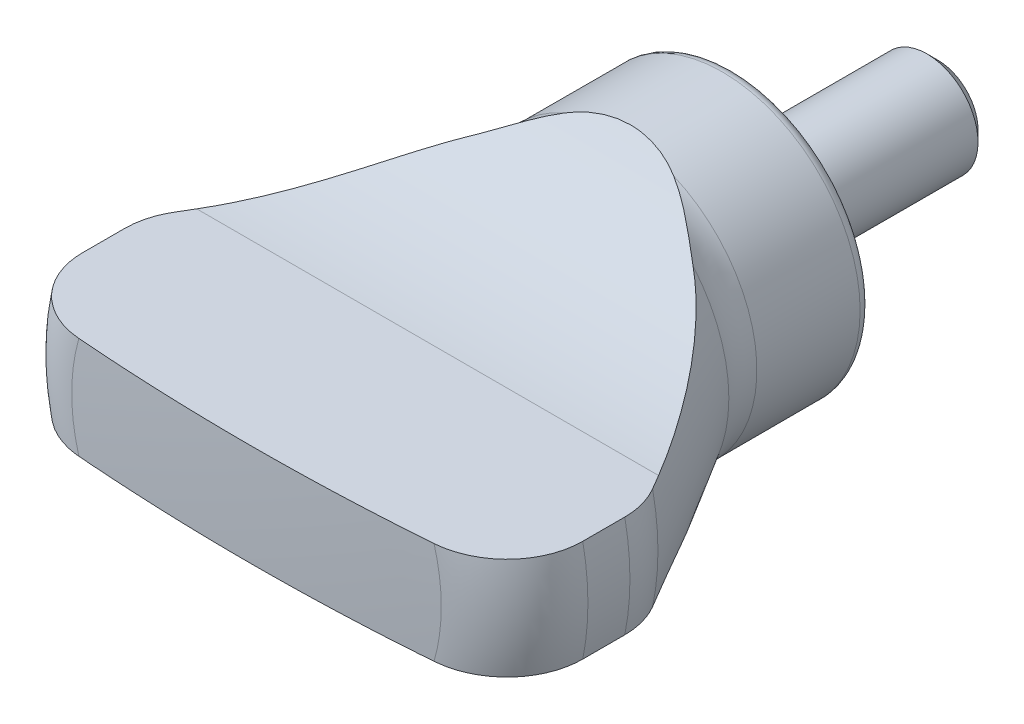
ISO-10303-21;
HEADER;
FILE_DESCRIPTION(('STEP AP214'),'2;1');
FILE_NAME('part.step','',(''),(''),'','','');
FILE_SCHEMA(('AUTOMOTIVE_DESIGN { 1 0 10303 214 1 1 1 1 }'));
ENDSEC;
DATA;
#1=APPLICATION_CONTEXT('core data for automotive mechanical design processes');
#2=APPLICATION_PROTOCOL_DEFINITION('international standard','automotive_design',2000,#1);
#3=PRODUCT_CONTEXT('',#1,'mechanical');
#4=PRODUCT('Part','Part','',(#3));
#5=PRODUCT_RELATED_PRODUCT_CATEGORY('part','',(#4));
#6=PRODUCT_DEFINITION_FORMATION('','',#4);
#7=PRODUCT_DEFINITION_CONTEXT('part definition',#1,'design');
#8=PRODUCT_DEFINITION('design','',#6,#7);
#9=PRODUCT_DEFINITION_SHAPE('','',#8);
#10=(LENGTH_UNIT() NAMED_UNIT(*) SI_UNIT(.MILLI.,.METRE.));
#11=(NAMED_UNIT(*) PLANE_ANGLE_UNIT() SI_UNIT($,.RADIAN.));
#12=(NAMED_UNIT(*) SI_UNIT($,.STERADIAN.) SOLID_ANGLE_UNIT());
#13=UNCERTAINTY_MEASURE_WITH_UNIT(LENGTH_MEASURE(1.E-05),#10,'distance_accuracy_value','');
#14=(GEOMETRIC_REPRESENTATION_CONTEXT(3) GLOBAL_UNCERTAINTY_ASSIGNED_CONTEXT((#13)) GLOBAL_UNIT_ASSIGNED_CONTEXT((#10,
#11,#12)) REPRESENTATION_CONTEXT('',''));
#15=CARTESIAN_POINT('',(0.,0.,0.));
#16=DIRECTION('',(0.,0.,1.));
#17=DIRECTION('',(1.,0.,0.));
#18=AXIS2_PLACEMENT_3D('',#15,#16,#17);
#19=CARTESIAN_POINT('',(-1.64018104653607E-12,0.,-71.0000000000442));
#20=DIRECTION('',(0.,0.,-1.));
#21=DIRECTION('',(1.,0.,0.));
#22=AXIS2_PLACEMENT_3D('',#19,#20,#21);
#23=SPHERICAL_SURFACE('',#22,90.0000000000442);
#24=CARTESIAN_POINT('',(0.,0.,18.7082071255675));
#25=DIRECTION('',(0.,0.,-1.));
#26=DIRECTION('',(0.,1.,0.));
#27=AXIS2_PLACEMENT_3D('',#24,#25,#26);
#28=CIRCLE('',#27,7.24137931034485);
#29=CARTESIAN_POINT('',(-6.95971079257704,-2.,18.7082071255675));
#30=VERTEX_POINT('',#29);
#31=CARTESIAN_POINT('',(-6.95971079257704,2.,18.7082071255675));
#32=VERTEX_POINT('',#31);
#33=EDGE_CURVE('E334',#30,#32,#28,.T.);
#34=ORIENTED_EDGE('',*,*,#33,.F.);
#35=CARTESIAN_POINT('',(-1.64018104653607E-12,-2.,-71.0000000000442));
#36=DIRECTION('',(0.,-1.,0.));
#37=DIRECTION('',(1.,0.,0.));
#38=AXIS2_PLACEMENT_3D('',#35,#36,#37);
#39=CIRCLE('',#38,89.9777750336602);
#40=CARTESIAN_POINT('',(6.9597107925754,-2.,18.7082071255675));
#41=VERTEX_POINT('',#40);
#42=EDGE_CURVE('E287',#30,#41,#39,.F.);
#43=ORIENTED_EDGE('',*,*,#42,.T.);
#44=CARTESIAN_POINT('',(6.9597107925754,2.,18.7082071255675));
#45=VERTEX_POINT('',#44);
#46=EDGE_CURVE('E335',#45,#41,#28,.T.);
#47=ORIENTED_EDGE('',*,*,#46,.F.);
#48=CARTESIAN_POINT('',(-1.64018104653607E-12,2.,-71.0000000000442));
#49=DIRECTION('',(0.,1.,0.));
#50=DIRECTION('',(-1.,0.,0.));
#51=AXIS2_PLACEMENT_3D('',#48,#49,#50);
#52=CIRCLE('',#51,89.9777750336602);
#53=EDGE_CURVE('E309',#45,#32,#52,.F.);
#54=ORIENTED_EDGE('',*,*,#53,.T.);
#55=EDGE_LOOP('',(#34,#43,#47,#54));
#56=FACE_BOUND('',#55,.T.);
#57=ADVANCED_FACE('F14',(#56),#23,.T.);
#58=CARTESIAN_POINT('',(0.,0.,15.7179335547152));
#59=DIRECTION('',(0.,0.,-1.));
#60=DIRECTION('',(0.,1.,0.));
#61=AXIS2_PLACEMENT_3D('',#58,#59,#60);
#62=TOROIDAL_SURFACE('',#61,7.,3.);
#63=CARTESIAN_POINT('',(0.,0.,15.7179335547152));
#64=DIRECTION('',(0.,0.,-1.));
#65=DIRECTION('',(0.,1.,0.));
#66=AXIS2_PLACEMENT_3D('',#63,#64,#65);
#67=CIRCLE('',#66,10.);
#68=CARTESIAN_POINT('',(-9.79795897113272,-2.,15.7179335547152));
#69=VERTEX_POINT('',#68);
#70=CARTESIAN_POINT('',(-9.79795897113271,2.,15.7179335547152));
#71=VERTEX_POINT('',#70);
#72=EDGE_CURVE('E331',#69,#71,#67,.T.);
#73=ORIENTED_EDGE('',*,*,#72,.F.);
#74=CARTESIAN_POINT('',(-9.1690514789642,-2.,17.5382309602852));
#75=CARTESIAN_POINT('',(-9.06353159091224,-2.,17.6732748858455));
#76=CARTESIAN_POINT('',(-8.94629487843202,-2.,17.7993591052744));
#77=CARTESIAN_POINT('',(-8.69206750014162,-2.,18.0299917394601));
#78=CARTESIAN_POINT('',(-8.5550465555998,-2.,18.1345065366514));
#79=CARTESIAN_POINT('',(-8.26572170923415,-2.,18.3190307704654));
#80=CARTESIAN_POINT('',(-8.11344388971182,-2.,18.3990811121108));
#81=CARTESIAN_POINT('',(-7.79789053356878,-2.,18.5330711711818));
#82=CARTESIAN_POINT('',(-7.63461799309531,-2.,18.5870179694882));
#83=CARTESIAN_POINT('',(-7.2978156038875,-2.,18.6687826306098));
#84=CARTESIAN_POINT('',(-7.12413832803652,-2.,18.6959921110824));
#85=CARTESIAN_POINT('',(-6.77467134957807,-2.,18.7219881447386));
#86=CARTESIAN_POINT('',(-6.59888118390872,-2.,18.7207683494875));
#87=CARTESIAN_POINT('',(-6.24322209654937,-2.,18.6898989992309));
#88=CARTESIAN_POINT('',(-6.06344497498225,-2.,18.6591927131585));
#89=CARTESIAN_POINT('',(-5.71121970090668,-2.,18.5691241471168));
#90=CARTESIAN_POINT('',(-5.53877299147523,-2.,18.5097562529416));
#91=CARTESIAN_POINT('',(-5.19956390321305,-2.,18.3615562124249));
#92=CARTESIAN_POINT('',(-5.03323229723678,-2.,18.2717366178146));
#93=CARTESIAN_POINT('',(-4.71772687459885,-2.,18.0656595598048));
#94=CARTESIAN_POINT('',(-4.56855961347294,-2.,17.9493920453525));
#95=CARTESIAN_POINT('',(-4.29105412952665,-2.,17.6921762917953));
#96=CARTESIAN_POINT('',(-4.16288688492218,-2.,17.5510431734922));
#97=CARTESIAN_POINT('',(-3.93401349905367,-2.,17.2477837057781));
#98=CARTESIAN_POINT('',(-3.83329575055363,-2.,17.085666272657));
#99=CARTESIAN_POINT('',(-3.71017324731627,-2.,16.8361950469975));
#100=CARTESIAN_POINT('',(-3.67466394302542,-2.,16.7551271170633));
#101=CARTESIAN_POINT('',(-3.61144842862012,-2.,16.5900195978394));
#102=CARTESIAN_POINT('',(-3.58373774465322,-2.,16.5059817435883));
#103=CARTESIAN_POINT('',(-3.53666405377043,-2.,16.3356866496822));
#104=CARTESIAN_POINT('',(-3.51729299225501,-2.,16.2494316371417));
#105=CARTESIAN_POINT('',(-3.48727342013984,-2.,16.0754171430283));
#106=CARTESIAN_POINT('',(-3.47662363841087,-2.,15.9876578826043));
#107=CARTESIAN_POINT('',(-3.46508469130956,-2.,15.8228751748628));
#108=CARTESIAN_POINT('',(-3.46311452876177,-2.,15.7459256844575));
#109=CARTESIAN_POINT('',(-3.4660093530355,-2.,15.5921292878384));
#110=CARTESIAN_POINT('',(-3.47087649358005,-2.,15.515282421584));
#111=CARTESIAN_POINT('',(-3.48736245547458,-2.,15.3623449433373));
#112=CARTESIAN_POINT('',(-3.49897870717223,-2.,15.2862540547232));
#113=CARTESIAN_POINT('',(-3.52875395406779,-2.,15.1353538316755));
#114=CARTESIAN_POINT('',(-3.54691549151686,-2.,15.0605450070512));
#115=CARTESIAN_POINT('',(-3.60908093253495,-2.,14.8448499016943));
#116=CARTESIAN_POINT('',(-3.66150708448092,-2.,14.7063085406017));
#117=CARTESIAN_POINT('',(-3.78683170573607,-2.,14.4389489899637));
#118=CARTESIAN_POINT('',(-3.85973615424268,-2.,14.3101336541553));
#119=CARTESIAN_POINT('',(-4.03113254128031,-2.,14.0525149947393));
#120=CARTESIAN_POINT('',(-4.13140818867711,-2.,13.9248982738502));
#121=CARTESIAN_POINT('',(-4.34987502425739,-2.,13.6860687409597));
#122=CARTESIAN_POINT('',(-4.46807460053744,-2.,13.5748636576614));
#123=CARTESIAN_POINT('',(-4.73397591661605,-2.,13.3588045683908));
#124=CARTESIAN_POINT('',(-4.88351037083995,-2.,13.2561988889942));
#125=CARTESIAN_POINT('',(-5.19700820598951,-2.,13.0760618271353));
#126=CARTESIAN_POINT('',(-5.36097604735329,-2.,12.9985382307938));
#127=CARTESIAN_POINT('',(-5.70796944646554,-2.,12.8673176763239));
#128=CARTESIAN_POINT('',(-5.89154196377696,-2.,12.8150589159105));
#129=CARTESIAN_POINT('',(-6.26492080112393,-2.,12.7425150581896));
#130=CARTESIAN_POINT('',(-6.45472700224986,-2.,12.7222293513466));
#131=CARTESIAN_POINT('',(-6.83263411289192,-2.,12.7149109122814));
#132=CARTESIAN_POINT('',(-7.02072665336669,-2.,12.7274653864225));
#133=CARTESIAN_POINT('',(-7.39183456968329,-2.,12.7852685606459));
#134=CARTESIAN_POINT('',(-7.57485093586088,-2.,12.8305108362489));
#135=CARTESIAN_POINT('',(-7.92313555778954,-2.,12.9505733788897));
#136=CARTESIAN_POINT('',(-8.08881410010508,-2.,13.0242031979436));
#137=CARTESIAN_POINT('',(-8.40477257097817,-2.,13.1992715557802));
#138=CARTESIAN_POINT('',(-8.55505576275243,-2.,13.3007041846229));
#139=CARTESIAN_POINT('',(-8.83007287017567,-2.,13.5243742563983));
#140=CARTESIAN_POINT('',(-8.95554673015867,-2.,13.645702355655));
#141=CARTESIAN_POINT('',(-9.18364139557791,-2.,13.9082202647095));
#142=CARTESIAN_POINT('',(-9.28626589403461,-2.,14.0494068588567));
#143=CARTESIAN_POINT('',(-9.46288130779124,-2.,14.3434525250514));
#144=CARTESIAN_POINT('',(-9.53757493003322,-2.,14.4958898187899));
#145=CARTESIAN_POINT('',(-9.65982030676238,-2.,14.811276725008));
#146=CARTESIAN_POINT('',(-9.70737610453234,-2.,14.9742247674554));
#147=CARTESIAN_POINT('',(-9.77329183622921,-2.,15.3031274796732));
#148=CARTESIAN_POINT('',(-9.79211873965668,-2.,15.4689887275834));
#149=CARTESIAN_POINT('',(-9.80147415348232,-2.,15.8015555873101));
#150=CARTESIAN_POINT('',(-9.79199607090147,-2.,15.9682613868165));
#151=CARTESIAN_POINT('',(-9.74516646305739,-2.,16.2967408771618));
#152=CARTESIAN_POINT('',(-9.70796979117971,-2.,16.4585367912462));
#153=CARTESIAN_POINT('',(-9.60704397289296,-2.,16.7734590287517));
#154=CARTESIAN_POINT('',(-9.5433508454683,-2.,16.9265968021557));
#155=CARTESIAN_POINT('',(-9.42505553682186,-2.,17.1551805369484));
#156=CARTESIAN_POINT('',(-9.37885045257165,-2.,17.2350829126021));
#157=CARTESIAN_POINT('',(-9.27924541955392,-2.,17.390265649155));
#158=CARTESIAN_POINT('',(-9.22584559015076,-2.,17.4655460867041));
#159=CARTESIAN_POINT('',(-9.1690514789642,-2.,17.5382309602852));
#160=B_SPLINE_CURVE_WITH_KNOTS('',3,(#74,#75,#76,#77,#78,#79,#80,#81,#82,#83,#84,#85,#86,#87,
#88,#89,#90,#91,#92,#93,#94,#95,#96,#97,#98,#99,#100,#101,#102,#103,#104,#105,#106,#107,#108,
#109,#110,#111,#112,#113,#114,#115,#116,#117,#118,#119,#120,#121,#122,#123,#124,#125,#126,#127,
#128,#129,#130,#131,#132,#133,#134,#135,#136,#137,#138,#139,#140,#141,#142,#143,#144,#145,#146,
#147,#148,#149,#150,#151,#152,#153,#154,#155,#156,#157,#158,#159),.UNSPECIFIED.,.T.,.F.,(4,2,2,
2,2,2,2,2,2,2,2,2,2,2,2,2,2,2,2,2,2,2,2,2,2,2,2,2,2,2,2,2,2,2,2,2,2,2,2,2,2,2,4),(0.,
0.513793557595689,1.02838195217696,1.54210517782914,2.05568897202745,2.58070552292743,
3.10583931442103,3.65052350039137,4.19531442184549,4.75979734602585,5.32449515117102,
5.89358385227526,6.46243153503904,6.72762510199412,6.99266622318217,7.25745078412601,
7.52219674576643,7.75282442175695,7.98352476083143,8.21413732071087,8.44483954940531,
8.88719956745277,9.32968887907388,9.81462652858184,10.2997918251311,10.8414656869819,
11.3833075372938,11.9531481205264,12.5229778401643,13.0856794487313,13.6482704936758,
14.1894634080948,14.7305413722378,15.2515859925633,15.7725463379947,16.2793411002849,
16.7860603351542,17.2844519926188,17.7829597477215,18.278703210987,18.7737749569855,
19.0503193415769,19.3268591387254),.UNSPECIFIED.);
#161=EDGE_CURVE('E344',#69,#30,#160,.T.);
#162=ORIENTED_EDGE('',*,*,#161,.T.);
#163=ORIENTED_EDGE('',*,*,#33,.T.);
#164=CARTESIAN_POINT('',(-9.1690514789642,2.,17.5382309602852));
#165=CARTESIAN_POINT('',(-9.27149654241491,2.,17.4070966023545));
#166=CARTESIAN_POINT('',(-9.36305742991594,2.,17.2673129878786));
#167=CARTESIAN_POINT('',(-9.52154430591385,2.,16.9742704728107));
#168=CARTESIAN_POINT('',(-9.58844385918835,2.,16.8209973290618));
#169=CARTESIAN_POINT('',(-9.69546141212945,2.,16.5053514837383));
#170=CARTESIAN_POINT('',(-9.73557989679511,2.,16.3429789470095));
#171=CARTESIAN_POINT('',(-9.78776824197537,2.,16.0138250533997));
#172=CARTESIAN_POINT('',(-9.79984467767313,2.,15.8470447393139));
#173=CARTESIAN_POINT('',(-9.7956090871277,2.,15.5149402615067));
#174=CARTESIAN_POINT('',(-9.77948227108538,2.,15.3496137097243));
#175=CARTESIAN_POINT('',(-9.71969439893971,2.,15.0240176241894));
#176=CARTESIAN_POINT('',(-9.67603297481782,2.,14.8637481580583));
#177=CARTESIAN_POINT('',(-9.5625163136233,2.,14.5527855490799));
#178=CARTESIAN_POINT('',(-9.49266198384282,2.,14.4020920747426));
#179=CARTESIAN_POINT('',(-9.32887528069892,2.,14.1144245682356));
#180=CARTESIAN_POINT('',(-9.23494229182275,2.,13.9774508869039));
#181=CARTESIAN_POINT('',(-9.02477844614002,2.,13.7196361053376));
#182=CARTESIAN_POINT('',(-8.9083417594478,2.,13.5989628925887));
#183=CARTESIAN_POINT('',(-8.65720404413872,2.,13.3784343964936));
#184=CARTESIAN_POINT('',(-8.52250172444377,2.,13.2785805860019));
#185=CARTESIAN_POINT('',(-8.2359104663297,2.,13.1003649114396));
#186=CARTESIAN_POINT('',(-8.08373796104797,2.,13.0224593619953));
#187=CARTESIAN_POINT('',(-7.76874637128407,2.,12.8924882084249));
#188=CARTESIAN_POINT('',(-7.60592601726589,2.,12.840425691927));
#189=CARTESIAN_POINT('',(-7.2691862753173,2.,12.7619085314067));
#190=CARTESIAN_POINT('',(-7.09508138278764,2.,12.7362504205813));
#191=CARTESIAN_POINT('',(-6.74502465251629,2.,12.7134057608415));
#192=CARTESIAN_POINT('',(-6.5690724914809,2.,12.7162242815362));
#193=CARTESIAN_POINT('',(-6.21333371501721,2.,12.7503564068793));
#194=CARTESIAN_POINT('',(-6.0336487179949,2.,12.7827284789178));
#195=CARTESIAN_POINT('',(-5.68187732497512,2.,12.8760995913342));
#196=CARTESIAN_POINT('',(-5.50979244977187,2.,12.937104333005));
#197=CARTESIAN_POINT('',(-5.17164281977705,2.,13.0885555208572));
#198=CARTESIAN_POINT('',(-5.00601492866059,2.,13.1799788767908));
#199=CARTESIAN_POINT('',(-4.69219987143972,2.,13.3891635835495));
#200=CARTESIAN_POINT('',(-4.54401947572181,2.,13.5069351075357));
#201=CARTESIAN_POINT('',(-4.26900633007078,2.,13.7668554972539));
#202=CARTESIAN_POINT('',(-4.1423143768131,2.,13.9091536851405));
#203=CARTESIAN_POINT('',(-3.91667263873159,2.,14.2145097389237));
#204=CARTESIAN_POINT('',(-3.81770963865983,2.,14.3775576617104));
#205=CARTESIAN_POINT('',(-3.69746879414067,2.,14.6279400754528));
#206=CARTESIAN_POINT('',(-3.66295810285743,2.,14.7091022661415));
#207=CARTESIAN_POINT('',(-3.60174866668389,2.,14.8743051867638));
#208=CARTESIAN_POINT('',(-3.57504543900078,2.,14.9583442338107));
#209=CARTESIAN_POINT('',(-3.52997967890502,2.,15.1285445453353));
#210=CARTESIAN_POINT('',(-3.51160924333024,2.,15.2147037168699));
#211=CARTESIAN_POINT('',(-3.48356557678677,2.,15.3884256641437));
#212=CARTESIAN_POINT('',(-3.4738911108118,2.,15.4759882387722));
#213=CARTESIAN_POINT('',(-3.46413096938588,2.,15.6403273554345));
#214=CARTESIAN_POINT('',(-3.46297157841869,2.,15.7170418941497));
#215=CARTESIAN_POINT('',(-3.46743972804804,2.,15.8702988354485));
#216=CARTESIAN_POINT('',(-3.47306940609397,2.,15.9468411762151));
#217=CARTESIAN_POINT('',(-3.49101899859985,2.,16.0991104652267));
#218=CARTESIAN_POINT('',(-3.50333652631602,2.,16.1748376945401));
#219=CARTESIAN_POINT('',(-3.53444439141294,2.,16.324960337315));
#220=CARTESIAN_POINT('',(-3.55323724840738,2.,16.3993552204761));
#221=CARTESIAN_POINT('',(-3.61732134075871,2.,16.6144115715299));
#222=CARTESIAN_POINT('',(-3.67103587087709,2.,16.7526459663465));
#223=CARTESIAN_POINT('',(-3.79882726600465,2.,17.0192261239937));
#224=CARTESIAN_POINT('',(-3.87291010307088,2.,17.1475689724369));
#225=CARTESIAN_POINT('',(-4.04685580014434,2.,17.404346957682));
#226=CARTESIAN_POINT('',(-4.14853718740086,2.,17.5315505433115));
#227=CARTESIAN_POINT('',(-4.36975558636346,2.,17.7693319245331));
#228=CARTESIAN_POINT('',(-4.48930103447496,2.,17.8799018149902));
#229=CARTESIAN_POINT('',(-4.7578335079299,2.,18.0942671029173));
#230=CARTESIAN_POINT('',(-4.9086260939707,2.,18.1958080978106));
#231=CARTESIAN_POINT('',(-5.22448220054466,2.,18.373571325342));
#232=CARTESIAN_POINT('',(-5.3895500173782,2.,18.4497859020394));
#233=CARTESIAN_POINT('',(-5.73823359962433,2.,18.5779397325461));
#234=CARTESIAN_POINT('',(-5.92236313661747,2.,18.6284890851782));
#235=CARTESIAN_POINT('',(-6.29655422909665,2.,18.697497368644));
#236=CARTESIAN_POINT('',(-6.48661538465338,2.,18.7159584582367));
#237=CARTESIAN_POINT('',(-6.86444459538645,2.,18.719582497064));
#238=CARTESIAN_POINT('',(-7.05220786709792,2.,18.7052040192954));
#239=CARTESIAN_POINT('',(-7.42239672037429,2.,18.6438219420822));
#240=CARTESIAN_POINT('',(-7.60482190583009,2.,18.5968159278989));
#241=CARTESIAN_POINT('',(-7.95167799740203,2.,18.473413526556));
#242=CARTESIAN_POINT('',(-8.11652825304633,2.,18.3981938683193));
#243=CARTESIAN_POINT('',(-8.43039951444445,2.,18.2201652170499));
#244=CARTESIAN_POINT('',(-8.57944450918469,2.,18.1173988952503));
#245=CARTESIAN_POINT('',(-8.80131054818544,2.,17.9333424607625));
#246=CARTESIAN_POINT('',(-8.88077170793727,2.,17.8599076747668));
#247=CARTESIAN_POINT('',(-9.03136976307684,2.,17.7049419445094));
#248=CARTESIAN_POINT('',(-9.10250682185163,2.,17.6234111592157));
#249=CARTESIAN_POINT('',(-9.1690514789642,2.,17.5382309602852));
#250=B_SPLINE_CURVE_WITH_KNOTS('',3,(#164,#165,#166,#167,#168,#169,#170,#171,#172,#173,#174,
#175,#176,#177,#178,#179,#180,#181,#182,#183,#184,#185,#186,#187,#188,#189,#190,#191,#192,#193,
#194,#195,#196,#197,#198,#199,#200,#201,#202,#203,#204,#205,#206,#207,#208,#209,#210,#211,#212,
#213,#214,#215,#216,#217,#218,#219,#220,#221,#222,#223,#224,#225,#226,#227,#228,#229,#230,#231,
#232,#233,#234,#235,#236,#237,#238,#239,#240,#241,#242,#243,#244,#245,#246,#247,#248,#249),
.UNSPECIFIED.,.T.,.F.,(4,2,2,2,2,2,2,2,2,2,2,2,2,2,2,2,2,2,2,2,2,2,2,2,2,2,2,2,2,2,2,2,2,2,2,2,
2,2,2,2,2,2,4),(0.,0.498830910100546,0.99819498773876,1.49755002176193,1.99678795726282,
2.49275970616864,2.98873808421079,3.48469928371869,3.9806731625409,4.48141873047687,
4.98219971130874,5.49273116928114,6.00332360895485,6.52890361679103,7.05457719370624,
7.59984951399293,8.14523045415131,8.71015958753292,9.27530722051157,9.84402563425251,
10.4124725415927,10.6767393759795,10.9408541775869,11.2047179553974,11.4685442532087,
11.6984204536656,11.9283690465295,12.1582356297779,12.3881917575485,12.8310811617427,
13.2741005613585,13.7606768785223,14.2474837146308,14.7904703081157,15.3336208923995,
15.903683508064,16.473707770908,17.0358209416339,17.5979757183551,18.138904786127,
18.6790007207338,19.0030298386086,19.3270525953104),.UNSPECIFIED.);
#251=EDGE_CURVE('E303',#32,#71,#250,.T.);
#252=ORIENTED_EDGE('',*,*,#251,.T.);
#253=EDGE_LOOP('',(#73,#162,#163,#252));
#254=FACE_BOUND('',#253,.T.);
#255=ADVANCED_FACE('F289',(#254),#62,.T.);
#256=CARTESIAN_POINT('',(9.79795897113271,2.,15.7179335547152));
#257=VERTEX_POINT('',#256);
#258=CARTESIAN_POINT('',(9.79795897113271,-2.,15.7179335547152));
#259=VERTEX_POINT('',#258);
#260=EDGE_CURVE('E332',#257,#259,#67,.T.);
#261=ORIENTED_EDGE('',*,*,#260,.F.);
#262=CARTESIAN_POINT('',(3.49470247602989,2.,16.1160256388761));
#263=CARTESIAN_POINT('',(3.47178318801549,2.,15.9673696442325));
#264=CARTESIAN_POINT('',(3.46162568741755,2.,15.8166484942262));
#265=CARTESIAN_POINT('',(3.46760947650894,2.,15.5156637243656));
#266=CARTESIAN_POINT('',(3.48376975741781,2.,15.3654005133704));
#267=CARTESIAN_POINT('',(3.54121822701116,2.,15.0702140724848));
#268=CARTESIAN_POINT('',(3.58244137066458,2.,14.9252780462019));
#269=CARTESIAN_POINT('',(3.68755339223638,2.,14.6439179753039));
#270=CARTESIAN_POINT('',(3.75144933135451,2.,14.5074965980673));
#271=CARTESIAN_POINT('',(3.90236096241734,2.,14.2399242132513));
#272=CARTESIAN_POINT('',(3.99029422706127,2.,14.1092932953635));
#273=CARTESIAN_POINT('',(4.18453508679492,2.,13.862529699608));
#274=CARTESIAN_POINT('',(4.29084904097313,2.,13.7464020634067));
#275=CARTESIAN_POINT('',(4.53309198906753,2.,13.5170524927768));
#276=CARTESIAN_POINT('',(4.67105874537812,2.,13.405978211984));
#277=CARTESIAN_POINT('',(4.96264893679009,2.,13.2067036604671));
#278=CARTESIAN_POINT('',(5.11627878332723,2.,13.1185128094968));
#279=CARTESIAN_POINT('',(5.44668157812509,2.,12.9617130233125));
#280=CARTESIAN_POINT('',(5.62432258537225,2.,12.8949240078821));
#281=CARTESIAN_POINT('',(5.98831222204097,2.,12.7920926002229));
#282=CARTESIAN_POINT('',(6.17466126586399,2.,12.7560516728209));
#283=CARTESIAN_POINT('',(6.55082069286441,2.,12.7162994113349));
#284=CARTESIAN_POINT('',(6.74063118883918,2.,12.7125891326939));
#285=CARTESIAN_POINT('',(7.11801183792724,2.,12.7383031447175));
#286=CARTESIAN_POINT('',(7.30558236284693,2.,12.7677218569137));
#287=CARTESIAN_POINT('',(7.6660812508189,2.,12.8578405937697));
#288=CARTESIAN_POINT('',(7.83929237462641,2.,12.9174084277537));
#289=CARTESIAN_POINT('',(8.17263048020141,2.,13.0659330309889));
#290=CARTESIAN_POINT('',(8.33276032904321,2.,13.1548833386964));
#291=CARTESIAN_POINT('',(8.62882312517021,2.,13.3558741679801));
#292=CARTESIAN_POINT('',(8.76545156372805,2.,13.4668906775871));
#293=CARTESIAN_POINT('',(9.01740318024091,2.,13.7109266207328));
#294=CARTESIAN_POINT('',(9.13273016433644,2.,13.8439421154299));
#295=CARTESIAN_POINT('',(9.33522917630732,2.,14.1238602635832));
#296=CARTESIAN_POINT('',(9.42313969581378,2.,14.2702290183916));
#297=CARTESIAN_POINT('',(9.5725877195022,2.,14.5758632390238));
#298=CARTESIAN_POINT('',(9.63412834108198,2.,14.7351271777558));
#299=CARTESIAN_POINT('',(9.72796602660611,2.,15.0587661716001));
#300=CARTESIAN_POINT('',(9.76079555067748,2.,15.2229870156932));
#301=CARTESIAN_POINT('',(9.79815532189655,2.,15.5546142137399));
#302=CARTESIAN_POINT('',(9.80268733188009,2.,15.7220203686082));
#303=CARTESIAN_POINT('',(9.783396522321,2.,16.0537478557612));
#304=CARTESIAN_POINT('',(9.75981558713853,2.,16.2180833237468));
#305=CARTESIAN_POINT('',(9.68542885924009,2.,16.5404663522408));
#306=CARTESIAN_POINT('',(9.63462342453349,2.,16.6985139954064));
#307=CARTESIAN_POINT('',(9.50725835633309,2.,17.0040925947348));
#308=CARTESIAN_POINT('',(9.43066629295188,2.,17.1516100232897));
#309=CARTESIAN_POINT('',(9.25405639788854,2.,17.4318722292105));
#310=CARTESIAN_POINT('',(9.15403777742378,2.,17.5646165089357));
#311=CARTESIAN_POINT('',(8.93232327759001,2.,17.813182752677));
#312=CARTESIAN_POINT('',(8.81040257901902,2.,17.9288040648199));
#313=CARTESIAN_POINT('',(8.54922533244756,2.,18.1384269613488));
#314=CARTESIAN_POINT('',(8.40996746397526,2.,18.2324268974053));
#315=CARTESIAN_POINT('',(8.11502606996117,2.,18.3983126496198));
#316=CARTESIAN_POINT('',(7.95906107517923,2.,18.4696976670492));
#317=CARTESIAN_POINT('',(7.63760671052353,2.,18.5861331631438));
#318=CARTESIAN_POINT('',(7.47211609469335,2.,18.6311801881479));
#319=CARTESIAN_POINT('',(7.13092550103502,2.,18.6952067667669));
#320=CARTESIAN_POINT('',(6.95506807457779,2.,18.713346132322));
#321=CARTESIAN_POINT('',(6.60274361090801,2.,18.7209892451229));
#322=CARTESIAN_POINT('',(6.42627647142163,2.,18.7104879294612));
#323=CARTESIAN_POINT('',(6.07062168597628,2.,18.660713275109));
#324=CARTESIAN_POINT('',(5.89158461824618,2.,18.6203640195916));
#325=CARTESIAN_POINT('',(5.54240746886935,2.,18.5112038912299));
#326=CARTESIAN_POINT('',(5.37226905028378,2.,18.4423877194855));
#327=CARTESIAN_POINT('',(5.03970097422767,2.,18.2754918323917));
#328=CARTESIAN_POINT('',(4.87772940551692,2.,18.1764975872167));
#329=CARTESIAN_POINT('',(4.57254419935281,2.,17.9526627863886));
#330=CARTESIAN_POINT('',(4.42934307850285,2.,17.8278051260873));
#331=CARTESIAN_POINT('',(4.16673595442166,2.,17.5552344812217));
#332=CARTESIAN_POINT('',(4.04731633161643,2.,17.4075346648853));
#333=CARTESIAN_POINT('',(3.83775587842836,2.,17.092836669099));
#334=CARTESIAN_POINT('',(3.74754666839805,2.,16.9258848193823));
#335=CARTESIAN_POINT('',(3.63217899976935,2.,16.6498982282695));
#336=CARTESIAN_POINT('',(3.59555746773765,2.,16.545554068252));
#337=CARTESIAN_POINT('',(3.53523351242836,2.,16.3331857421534));
#338=CARTESIAN_POINT('',(3.51152879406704,2.,16.2251622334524));
#339=CARTESIAN_POINT('',(3.49470247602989,2.,16.1160256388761));
#340=B_SPLINE_CURVE_WITH_KNOTS('',3,(#262,#263,#264,#265,#266,#267,#268,#269,#270,#271,#272,
#273,#274,#275,#276,#277,#278,#279,#280,#281,#282,#283,#284,#285,#286,#287,#288,#289,#290,#291,
#292,#293,#294,#295,#296,#297,#298,#299,#300,#301,#302,#303,#304,#305,#306,#307,#308,#309,#310,
#311,#312,#313,#314,#315,#316,#317,#318,#319,#320,#321,#322,#323,#324,#325,#326,#327,#328,#329,
#330,#331,#332,#333,#334,#335,#336,#337,#338,#339),.UNSPECIFIED.,.T.,.F.,(4,2,2,2,2,2,2,2,2,2,2,
2,2,2,2,2,2,2,2,2,2,2,2,2,2,2,2,2,2,2,2,2,2,2,2,2,2,2,4),(0.,0.450820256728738,
0.901965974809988,1.35194581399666,1.80206591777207,2.27261200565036,2.74332121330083,
3.27242460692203,3.8017454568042,4.36840101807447,4.93508357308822,5.50178462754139,
6.06839027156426,6.6151425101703,7.16177459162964,7.687303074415,8.21273756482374,
8.72246744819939,9.23213705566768,9.73214095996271,10.2321137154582,10.7278155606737,
11.2235108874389,11.7198319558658,12.2161697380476,12.7179283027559,13.2197251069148,
13.7319623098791,14.244266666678,14.7722536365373,15.3003339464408,15.8484387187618,
16.3966455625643,16.9634718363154,17.5306741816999,18.0975507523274,18.6630905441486,
18.9941214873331,19.3250935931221),.UNSPECIFIED.);
#341=EDGE_CURVE('E296',#257,#45,#340,.T.);
#342=ORIENTED_EDGE('',*,*,#341,.T.);
#343=ORIENTED_EDGE('',*,*,#46,.T.);
#344=CARTESIAN_POINT('',(3.49470247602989,-2.,16.1160256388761));
#345=CARTESIAN_POINT('',(3.50707030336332,-2.,16.196197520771));
#346=CARTESIAN_POINT('',(3.5231438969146,-2.,16.275804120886));
#347=CARTESIAN_POINT('',(3.56239972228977,-2.,16.4332567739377));
#348=CARTESIAN_POINT('',(3.58558547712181,-2.,16.5111019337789));
#349=CARTESIAN_POINT('',(3.66535853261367,-2.,16.7414027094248));
#350=CARTESIAN_POINT('',(3.73213249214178,-2.,16.8904418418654));
#351=CARTESIAN_POINT('',(3.88861553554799,-2.,17.1746149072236));
#352=CARTESIAN_POINT('',(3.97819351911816,-2.,17.3098223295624));
#353=CARTESIAN_POINT('',(4.17690289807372,-2.,17.5648904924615));
#354=CARTESIAN_POINT('',(4.28602992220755,-2.,17.6847546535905));
#355=CARTESIAN_POINT('',(4.53121457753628,-2.,17.9171961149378));
#356=CARTESIAN_POINT('',(4.66881113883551,-2.,18.0281502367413));
#357=CARTESIAN_POINT('',(4.95962281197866,-2.,18.2272945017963));
#358=CARTESIAN_POINT('',(5.11284409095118,-2.,18.3154756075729));
#359=CARTESIAN_POINT('',(5.44271072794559,-2.,18.472530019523));
#360=CARTESIAN_POINT('',(5.62024907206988,-2.,18.5395370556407));
#361=CARTESIAN_POINT('',(5.98407556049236,-2.,18.6428270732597));
#362=CARTESIAN_POINT('',(6.17036438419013,-2.,18.6791076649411));
#363=CARTESIAN_POINT('',(6.54647691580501,-2.,18.719356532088));
#364=CARTESIAN_POINT('',(6.73630133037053,-2.,18.7233182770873));
#365=CARTESIAN_POINT('',(7.11375145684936,-2.,18.6981031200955));
#366=CARTESIAN_POINT('',(7.30137755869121,-2.,18.6689321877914));
#367=CARTESIAN_POINT('',(7.66204066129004,-2.,18.5792858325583));
#368=CARTESIAN_POINT('',(7.8353584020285,-2.,18.5199409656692));
#369=CARTESIAN_POINT('',(8.16894750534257,-2.,18.3718393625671));
#370=CARTESIAN_POINT('',(8.32922167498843,-2.,18.2830889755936));
#371=CARTESIAN_POINT('',(8.62559607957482,-2.,18.0824630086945));
#372=CARTESIAN_POINT('',(8.76239095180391,-2.,17.9716131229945));
#373=CARTESIAN_POINT('',(9.01470063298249,-2.,17.727878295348));
#374=CARTESIAN_POINT('',(9.13021927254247,-2.,17.5949973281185));
#375=CARTESIAN_POINT('',(9.33311030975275,-2.,17.3153137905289));
#376=CARTESIAN_POINT('',(9.42122162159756,-2.,17.1690469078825));
#377=CARTESIAN_POINT('',(9.57108453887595,-2.,16.8635800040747));
#378=CARTESIAN_POINT('',(9.6328392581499,-2.,16.7043815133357));
#379=CARTESIAN_POINT('',(9.7271052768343,-2.,16.3808410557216));
#380=CARTESIAN_POINT('',(9.7601500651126,-2.,16.216654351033));
#381=CARTESIAN_POINT('',(9.79794187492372,-2.,15.885058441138));
#382=CARTESIAN_POINT('',(9.80269066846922,-2.,15.7176494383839));
#383=CARTESIAN_POINT('',(9.78382667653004,-2.,15.3858863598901));
#384=CARTESIAN_POINT('',(9.7604569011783,-2.,15.2215183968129));
#385=CARTESIAN_POINT('',(9.68648301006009,-2.,14.8990356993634));
#386=CARTESIAN_POINT('',(9.63587925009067,-2.,14.7409208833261));
#387=CARTESIAN_POINT('',(9.50890463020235,-2.,14.4351813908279));
#388=CARTESIAN_POINT('',(9.43250225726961,-2.,14.2875698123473));
#389=CARTESIAN_POINT('',(9.25625267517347,-2.,14.0070898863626));
#390=CARTESIAN_POINT('',(9.15640470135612,-2.,13.8742220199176));
#391=CARTESIAN_POINT('',(8.9350136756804,-2.,13.6253865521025));
#392=CARTESIAN_POINT('',(8.81324633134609,-2.,13.5096186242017));
#393=CARTESIAN_POINT('',(8.55234864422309,-2.,13.2996798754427));
#394=CARTESIAN_POINT('',(8.4132169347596,-2.,13.2055107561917));
#395=CARTESIAN_POINT('',(8.11850563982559,-2.,13.03926914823));
#396=CARTESIAN_POINT('',(7.96264445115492,-2.,12.9676962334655));
#397=CARTESIAN_POINT('',(7.64136656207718,-2.,12.850872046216));
#398=CARTESIAN_POINT('',(7.47594867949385,-2.,12.8056240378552));
#399=CARTESIAN_POINT('',(7.1348783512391,-2.,12.7411826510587));
#400=CARTESIAN_POINT('',(6.95906762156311,-2.,12.7228281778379));
#401=CARTESIAN_POINT('',(6.60679938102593,-2.,12.7147502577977));
#402=CARTESIAN_POINT('',(6.43034175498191,-2.,12.725032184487));
#403=CARTESIAN_POINT('',(6.07467605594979,-2.,12.7743612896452));
#404=CARTESIAN_POINT('',(5.89561707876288,-2.,12.8144835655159));
#405=CARTESIAN_POINT('',(5.54635691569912,-2.,12.9231927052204));
#406=CARTESIAN_POINT('',(5.37615756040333,-2.,12.9917854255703));
#407=CARTESIAN_POINT('',(5.04338946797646,-2.,13.1582640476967));
#408=CARTESIAN_POINT('',(4.88128017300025,-2.,13.2570707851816));
#409=CARTESIAN_POINT('',(4.57585396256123,-2.,13.4804777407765));
#410=CARTESIAN_POINT('',(4.43254379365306,-2.,13.6050871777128));
#411=CARTESIAN_POINT('',(4.16966907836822,-2.,13.877249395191));
#412=CARTESIAN_POINT('',(4.05007738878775,-2.,14.0247756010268));
#413=CARTESIAN_POINT('',(3.89254775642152,-2.,14.2604657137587));
#414=CARTESIAN_POINT('',(3.84366142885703,-2.,14.3414744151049));
#415=CARTESIAN_POINT('',(3.75387086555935,-2.,14.507781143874));
#416=CARTESIAN_POINT('',(3.71296169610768,-2.,14.5930764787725));
#417=CARTESIAN_POINT('',(3.64284669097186,-2.,14.7601343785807));
#418=CARTESIAN_POINT('',(3.61295453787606,-2.,14.8416094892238));
#419=CARTESIAN_POINT('',(3.5610172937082,-2.,15.0069833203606));
#420=CARTESIAN_POINT('',(3.53896754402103,-2.,15.090880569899));
#421=CARTESIAN_POINT('',(3.5031702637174,-2.,15.2602415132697));
#422=CARTESIAN_POINT('',(3.4894047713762,-2.,15.3457014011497));
#423=CARTESIAN_POINT('',(3.47040653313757,-2.,15.5175250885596));
#424=CARTESIAN_POINT('',(3.46516895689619,-2.,15.6038883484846));
#425=CARTESIAN_POINT('',(3.46349011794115,-2.,15.7615090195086));
#426=CARTESIAN_POINT('',(3.46566524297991,-2.,15.8327549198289));
#427=CARTESIAN_POINT('',(3.47584274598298,-2.,15.9748209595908));
#428=CARTESIAN_POINT('',(3.48384451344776,-2.,16.045641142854));
#429=CARTESIAN_POINT('',(3.49470247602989,-2.,16.1160256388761));
#430=B_SPLINE_CURVE_WITH_KNOTS('',3,(#344,#345,#346,#347,#348,#349,#350,#351,#352,#353,#354,
#355,#356,#357,#358,#359,#360,#361,#362,#363,#364,#365,#366,#367,#368,#369,#370,#371,#372,#373,
#374,#375,#376,#377,#378,#379,#380,#381,#382,#383,#384,#385,#386,#387,#388,#389,#390,#391,#392,
#393,#394,#395,#396,#397,#398,#399,#400,#401,#402,#403,#404,#405,#406,#407,#408,#409,#410,#411,
#412,#413,#414,#415,#416,#417,#418,#419,#420,#421,#422,#423,#424,#425,#426,#427,#428,#429),
.UNSPECIFIED.,.T.,.F.,(4,2,2,2,2,2,2,2,2,2,2,2,2,2,2,2,2,2,2,2,2,2,2,2,2,2,2,2,2,2,2,2,2,2,2,2,
2,2,2,2,2,2,4),(0.,0.243280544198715,0.486681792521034,0.974028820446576,1.45863498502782,
1.94313292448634,2.47117624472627,2.99942879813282,3.5660282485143,4.13267176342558,
4.69942977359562,5.26608568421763,5.81292283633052,6.35964199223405,6.88524270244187,
7.41074868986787,7.92052679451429,8.43024465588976,8.93027489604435,9.43027382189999,
9.92598244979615,10.4216846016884,10.9179944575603,11.4143205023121,11.9160483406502,
12.4178156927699,12.9300048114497,13.4422574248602,13.9701719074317,14.4981854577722,
15.0462043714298,15.5943360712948,16.1611968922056,16.7282605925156,17.2946715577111,
17.5781676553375,17.8614878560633,18.121478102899,18.3813136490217,18.6405837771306,
18.8997069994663,19.1133102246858,19.3268910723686),.UNSPECIFIED.);
#431=EDGE_CURVE('E281',#41,#259,#430,.T.);
#432=ORIENTED_EDGE('',*,*,#431,.T.);
#433=EDGE_LOOP('',(#261,#342,#343,#432));
#434=FACE_BOUND('',#433,.T.);
#435=ADVANCED_FACE('F292',(#434),#62,.T.);
#436=CARTESIAN_POINT('',(0.,0.,0.));
#437=DIRECTION('',(0.,0.,-1.));
#438=DIRECTION('',(0.,1.,0.));
#439=AXIS2_PLACEMENT_3D('',#436,#437,#438);
#440=CYLINDRICAL_SURFACE('',#439,10.);
#441=DIRECTION('',(0.,0.,-1.));
#442=VECTOR('',#441,1.);
#443=CARTESIAN_POINT('',(-9.79795897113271,-2.,0.));
#444=LINE('',#443,#442);
#445=CARTESIAN_POINT('',(-9.79795897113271,-2.,14.0712812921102));
#446=VERTEX_POINT('',#445);
#447=EDGE_CURVE('E390',#69,#446,#444,.T.);
#448=ORIENTED_EDGE('',*,*,#447,.F.);
#449=ORIENTED_EDGE('',*,*,#72,.T.);
#450=DIRECTION('',(0.,0.,-1.));
#451=VECTOR('',#450,1.);
#452=CARTESIAN_POINT('',(-9.79795897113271,2.,0.));
#453=LINE('',#452,#451);
#454=CARTESIAN_POINT('',(-9.79795897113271,2.,14.0712812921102));
#455=VERTEX_POINT('',#454);
#456=EDGE_CURVE('E308',#455,#71,#453,.F.);
#457=ORIENTED_EDGE('',*,*,#456,.F.);
#458=CARTESIAN_POINT('',(0.,0.,14.0712812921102));
#459=DIRECTION('',(0.,0.,-1.));
#460=DIRECTION('',(0.,1.,0.));
#461=AXIS2_PLACEMENT_3D('',#458,#459,#460);
#462=CIRCLE('',#461,10.);
#463=EDGE_CURVE('E318',#446,#455,#462,.T.);
#464=ORIENTED_EDGE('',*,*,#463,.F.);
#465=EDGE_LOOP('',(#448,#449,#457,#464));
#466=FACE_BOUND('',#465,.T.);
#467=ADVANCED_FACE('F261',(#466),#440,.T.);
#468=DIRECTION('',(0.,0.,-1.));
#469=VECTOR('',#468,1.);
#470=CARTESIAN_POINT('',(9.79795897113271,2.,0.));
#471=LINE('',#470,#469);
#472=CARTESIAN_POINT('',(9.79795897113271,2.,14.0712812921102));
#473=VERTEX_POINT('',#472);
#474=EDGE_CURVE('E252',#257,#473,#471,.T.);
#475=ORIENTED_EDGE('',*,*,#474,.F.);
#476=ORIENTED_EDGE('',*,*,#260,.T.);
#477=DIRECTION('',(0.,0.,-1.));
#478=VECTOR('',#477,1.);
#479=CARTESIAN_POINT('',(9.79795897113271,-2.,0.));
#480=LINE('',#479,#478);
#481=CARTESIAN_POINT('',(9.79795897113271,-2.,14.0712812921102));
#482=VERTEX_POINT('',#481);
#483=EDGE_CURVE('E279',#482,#259,#480,.F.);
#484=ORIENTED_EDGE('',*,*,#483,.F.);
#485=EDGE_CURVE('E328',#473,#482,#462,.T.);
#486=ORIENTED_EDGE('',*,*,#485,.F.);
#487=EDGE_LOOP('',(#475,#476,#484,#486));
#488=FACE_BOUND('',#487,.T.);
#489=ADVANCED_FACE('F259',(#488),#440,.T.);
#490=CARTESIAN_POINT('',(0.,0.,14.0712812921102));
#491=DIRECTION('',(0.,0.,-1.));
#492=DIRECTION('',(0.,1.,0.));
#493=AXIS2_PLACEMENT_3D('',#490,#491,#492);
#494=TOROIDAL_SURFACE('',#493,7.,3.);
#495=CARTESIAN_POINT('',(0.,0.,12.5712812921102));
#496=DIRECTION('',(0.,0.,-1.));
#497=DIRECTION('',(0.,1.,0.));
#498=AXIS2_PLACEMENT_3D('',#495,#496,#497);
#499=CIRCLE('',#498,9.59807621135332);
#500=CARTESIAN_POINT('',(-9.38738871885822,-2.,12.5712812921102));
#501=VERTEX_POINT('',#500);
#502=CARTESIAN_POINT('',(-9.38738871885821,2.,12.5712812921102));
#503=VERTEX_POINT('',#502);
#504=EDGE_CURVE('E316',#501,#503,#499,.T.);
#505=ORIENTED_EDGE('',*,*,#504,.F.);
#506=CARTESIAN_POINT('',(-9.59337970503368,-2.,12.9933115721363));
#507=CARTESIAN_POINT('',(-9.65389635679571,-2.,13.1471941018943));
#508=CARTESIAN_POINT('',(-9.70151778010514,-2.,13.3062795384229));
#509=CARTESIAN_POINT('',(-9.76941451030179,-2.,13.6303212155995));
#510=CARTESIAN_POINT('',(-9.78965762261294,-2.,13.7952841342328));
#511=CARTESIAN_POINT('',(-9.80210260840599,-2.,14.1262180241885));
#512=CARTESIAN_POINT('',(-9.79431507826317,-2.,14.2921885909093));
#513=CARTESIAN_POINT('',(-9.75095862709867,-2.,14.620412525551));
#514=CARTESIAN_POINT('',(-9.71539644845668,-2.,14.7826667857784));
#515=CARTESIAN_POINT('',(-9.61762561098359,-2.,15.0988201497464));
#516=CARTESIAN_POINT('',(-9.55543366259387,-2.,15.2527244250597));
#517=CARTESIAN_POINT('',(-9.4062926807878,-2.,15.5480261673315));
#518=CARTESIAN_POINT('',(-9.31934229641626,-2.,15.6894229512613));
#519=CARTESIAN_POINT('',(-9.12247872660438,-2.,15.9569865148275));
#520=CARTESIAN_POINT('',(-9.01238403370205,-2.,16.0830196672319));
#521=CARTESIAN_POINT('',(-8.77293379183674,-2.,16.3152057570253));
#522=CARTESIAN_POINT('',(-8.64357700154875,-2.,16.4213574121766));
#523=CARTESIAN_POINT('',(-8.36684882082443,-2.,16.6128886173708));
#524=CARTESIAN_POINT('',(-8.21919528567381,-2.,16.6978602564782));
#525=CARTESIAN_POINT('',(-7.91201545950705,-2.,16.8425658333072));
#526=CARTESIAN_POINT('',(-7.75248787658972,-2.,16.902297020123));
#527=CARTESIAN_POINT('',(-7.42136450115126,-2.,16.9966888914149));
#528=CARTESIAN_POINT('',(-7.2495561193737,-2.,17.0306030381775));
#529=CARTESIAN_POINT('',(-6.90272777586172,-2.,17.0701949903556));
#530=CARTESIAN_POINT('',(-6.72770726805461,-2.,17.0758679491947));
#531=CARTESIAN_POINT('',(-6.37263816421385,-2.,17.0590627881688));
#532=CARTESIAN_POINT('',(-6.1926385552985,-2.,17.0355520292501));
#533=CARTESIAN_POINT('',(-5.83880278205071,-2.,16.9597711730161));
#534=CARTESIAN_POINT('',(-5.66496781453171,-2.,16.9074955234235));
#535=CARTESIAN_POINT('',(-5.32157725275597,-2.,16.7734273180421));
#536=CARTESIAN_POINT('',(-5.15242189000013,-2.,16.6906083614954));
#537=CARTESIAN_POINT('',(-4.83004881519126,-2.,16.498125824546));
#538=CARTESIAN_POINT('',(-4.67683686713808,-2.,16.3884525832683));
#539=CARTESIAN_POINT('',(-4.38905130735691,-2.,16.1432523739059));
#540=CARTESIAN_POINT('',(-4.2547593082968,-2.,16.0073942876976));
#541=CARTESIAN_POINT('',(-4.01239685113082,-2.,15.7137367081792));
#542=CARTESIAN_POINT('',(-3.90432091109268,-2.,15.5559418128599));
#543=CARTESIAN_POINT('',(-3.76896916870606,-2.,15.3109328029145));
#544=CARTESIAN_POINT('',(-3.72916674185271,-2.,15.2304600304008));
#545=CARTESIAN_POINT('',(-3.65729797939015,-2.,15.0661469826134));
#546=CARTESIAN_POINT('',(-3.6252272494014,-2.,14.9823086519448));
#547=CARTESIAN_POINT('',(-3.56942781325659,-2.,14.8119925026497));
#548=CARTESIAN_POINT('',(-3.54569071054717,-2.,14.7255174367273));
#549=CARTESIAN_POINT('',(-3.50700906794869,-2.,14.5506224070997));
#550=CARTESIAN_POINT('',(-3.49206313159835,-2.,14.4622027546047));
#551=CARTESIAN_POINT('',(-3.47263559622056,-2.,14.2957059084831));
#552=CARTESIAN_POINT('',(-3.46705868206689,-2.,14.217754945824));
#553=CARTESIAN_POINT('',(-3.46294635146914,-2.,14.0616398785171));
#554=CARTESIAN_POINT('',(-3.46441316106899,-2.,13.9834757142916));
#555=CARTESIAN_POINT('',(-3.47436756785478,-2.,13.8276330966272));
#556=CARTESIAN_POINT('',(-3.48285164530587,-2.,13.7499544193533));
#557=CARTESIAN_POINT('',(-3.50667341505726,-2.,13.5956457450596));
#558=CARTESIAN_POINT('',(-3.52201373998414,-2.,13.5190161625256));
#559=CARTESIAN_POINT('',(-3.57577659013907,-2.,13.3004514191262));
#560=CARTESIAN_POINT('',(-3.62262518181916,-2.,13.1605081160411));
#561=CARTESIAN_POINT('',(-3.73731379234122,-2.,12.8896329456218));
#562=CARTESIAN_POINT('',(-3.8051598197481,-2.,12.7587036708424));
#563=CARTESIAN_POINT('',(-3.96562171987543,-2.,12.4975116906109));
#564=CARTESIAN_POINT('',(-4.05984420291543,-2.,12.3682367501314));
#565=CARTESIAN_POINT('',(-4.2664570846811,-2.,12.1251515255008));
#566=CARTESIAN_POINT('',(-4.37885569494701,-2.,12.0113482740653));
#567=CARTESIAN_POINT('',(-4.63327235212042,-2.,11.788377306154));
#568=CARTESIAN_POINT('',(-4.77722688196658,-2.,11.6814130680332));
#569=CARTESIAN_POINT('',(-5.08020289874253,-2.,11.4914866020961));
#570=CARTESIAN_POINT('',(-5.23922967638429,-2.,11.4085328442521));
#571=CARTESIAN_POINT('',(-5.57845281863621,-2.,11.2644214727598));
#572=CARTESIAN_POINT('',(-5.75934877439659,-2.,11.2049018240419));
#573=CARTESIAN_POINT('',(-6.12861818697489,-2.,11.1172834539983));
#574=CARTESIAN_POINT('',(-6.31699175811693,-2.,11.0891852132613));
#575=CARTESIAN_POINT('',(-6.69453548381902,-2.,11.0659040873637));
#576=CARTESIAN_POINT('',(-6.88369195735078,-2.,11.0705030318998));
#577=CARTESIAN_POINT('',(-7.25830495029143,-2.,11.1126583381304));
#578=CARTESIAN_POINT('',(-7.44376229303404,-2.,11.1502072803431));
#579=CARTESIAN_POINT('',(-7.79836177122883,-2.,11.2557524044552));
#580=CARTESIAN_POINT('',(-7.96785342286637,-2.,11.3225738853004));
#581=CARTESIAN_POINT('',(-8.29260322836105,-2.,11.4848450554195));
#582=CARTESIAN_POINT('',(-8.44786055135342,-2.,11.5802964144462));
#583=CARTESIAN_POINT('',(-8.73351042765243,-2.,11.793170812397));
#584=CARTESIAN_POINT('',(-8.86461522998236,-2.,11.9096397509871));
#585=CARTESIAN_POINT('',(-9.1045481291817,-2.,12.1634232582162));
#586=CARTESIAN_POINT('',(-9.21340953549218,-2.,12.3007061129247));
#587=CARTESIAN_POINT('',(-9.36603764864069,-2.,12.5322574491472));
#588=CARTESIAN_POINT('',(-9.41820087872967,-2.,12.6211055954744));
#589=CARTESIAN_POINT('',(-9.5130350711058,-2.,12.8037342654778));
#590=CARTESIAN_POINT('',(-9.55570613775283,-2.,12.8975147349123));
#591=CARTESIAN_POINT('',(-9.59337970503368,-2.,12.9933115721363));
#592=B_SPLINE_CURVE_WITH_KNOTS('',3,(#506,#507,#508,#509,#510,#511,#512,#513,#514,#515,#516,
#517,#518,#519,#520,#521,#522,#523,#524,#525,#526,#527,#528,#529,#530,#531,#532,#533,#534,#535,
#536,#537,#538,#539,#540,#541,#542,#543,#544,#545,#546,#547,#548,#549,#550,#551,#552,#553,#554,
#555,#556,#557,#558,#559,#560,#561,#562,#563,#564,#565,#566,#567,#568,#569,#570,#571,#572,#573,
#574,#575,#576,#577,#578,#579,#580,#581,#582,#583,#584,#585,#586,#587,#588,#589,#590,#591),
.UNSPECIFIED.,.T.,.F.,(4,2,2,2,2,2,2,2,2,2,2,2,2,2,2,2,2,2,2,2,2,2,2,2,2,2,2,2,2,2,2,2,2,2,2,2,
2,2,2,2,2,2,4),(0.,0.495688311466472,0.991959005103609,1.48804211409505,1.98400483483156,
2.47965678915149,2.97533579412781,3.47505771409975,3.97481185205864,4.48355384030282,
4.99235126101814,5.5153544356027,6.03844736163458,6.5805886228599,7.12283456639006,
7.68526714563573,8.24790235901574,8.81818430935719,9.38834690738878,9.65736097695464,
9.92622178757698,10.1948109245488,10.4633573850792,10.697499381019,10.9317153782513,
11.1658139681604,11.4000025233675,11.8406762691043,12.2814762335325,12.7594574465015,
13.2376552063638,13.773363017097,14.3092595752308,14.8778412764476,15.4464316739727,
16.0112317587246,16.5759046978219,17.1197400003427,17.6636070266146,18.1871549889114,
18.7099130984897,19.0184984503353,19.3270804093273),.UNSPECIFIED.);
#593=EDGE_CURVE('E385',#501,#446,#592,.T.);
#594=ORIENTED_EDGE('',*,*,#593,.T.);
#595=ORIENTED_EDGE('',*,*,#463,.T.);
#596=CARTESIAN_POINT('',(-9.59337970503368,2.,12.9933115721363));
#597=CARTESIAN_POINT('',(-9.53183364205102,2.,12.8368553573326));
#598=CARTESIAN_POINT('',(-9.45685579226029,2.,12.685527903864));
#599=CARTESIAN_POINT('',(-9.28235130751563,2.,12.3975709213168));
#600=CARTESIAN_POINT('',(-9.18278941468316,2.,12.2609629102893));
#601=CARTESIAN_POINT('',(-8.96234364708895,2.,12.0065075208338));
#602=CARTESIAN_POINT('',(-8.84148787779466,2.,11.8886357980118));
#603=CARTESIAN_POINT('',(-8.58200934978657,2.,11.674538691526));
#604=CARTESIAN_POINT('',(-8.44339130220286,2.,11.5783075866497));
#605=CARTESIAN_POINT('',(-8.15010050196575,2.,11.4084363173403));
#606=CARTESIAN_POINT('',(-7.99521398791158,2.,11.3351655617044));
#607=CARTESIAN_POINT('',(-7.67558657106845,2.,11.2148137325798));
#608=CARTESIAN_POINT('',(-7.51084404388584,2.,11.1677369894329));
#609=CARTESIAN_POINT('',(-7.17088465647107,2.,11.0995170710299));
#610=CARTESIAN_POINT('',(-6.99550167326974,2.,11.0792028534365));
#611=CARTESIAN_POINT('',(-6.64376812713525,2.,11.0671670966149));
#612=CARTESIAN_POINT('',(-6.46741739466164,2.,11.075450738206));
#613=CARTESIAN_POINT('',(-6.11167141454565,2.,11.1207142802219));
#614=CARTESIAN_POINT('',(-5.93241247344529,2.,11.1587654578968));
#615=CARTESIAN_POINT('',(-5.58241599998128,2.,11.2633790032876));
#616=CARTESIAN_POINT('',(-5.41168020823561,2.,11.3299471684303));
#617=CARTESIAN_POINT('',(-5.07740002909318,2.,11.4924277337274));
#618=CARTESIAN_POINT('',(-4.91430982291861,2.,11.5892770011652));
#619=CARTESIAN_POINT('',(-4.60656103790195,2.,11.8089110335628));
#620=CARTESIAN_POINT('',(-4.46190974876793,2.,11.9317060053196));
#621=CARTESIAN_POINT('',(-4.19566976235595,2.,12.2007057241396));
#622=CARTESIAN_POINT('',(-4.07410500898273,2.,12.3469344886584));
#623=CARTESIAN_POINT('',(-3.91339704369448,2.,12.5809025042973));
#624=CARTESIAN_POINT('',(-3.86341887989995,2.,12.6613637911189));
#625=CARTESIAN_POINT('',(-3.77136296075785,2.,12.826665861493));
#626=CARTESIAN_POINT('',(-3.72928036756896,2.,12.9115039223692));
#627=CARTESIAN_POINT('',(-3.65674414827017,2.,13.0780085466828));
#628=CARTESIAN_POINT('',(-3.62563062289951,2.,13.1593881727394));
#629=CARTESIAN_POINT('',(-3.57124047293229,2.,13.3246867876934));
#630=CARTESIAN_POINT('',(-3.54795935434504,2.,13.4086042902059));
#631=CARTESIAN_POINT('',(-3.50968751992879,2.,13.5782371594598));
#632=CARTESIAN_POINT('',(-3.49468958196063,2.,13.6639508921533));
#633=CARTESIAN_POINT('',(-3.47328099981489,2.,13.8364420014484));
#634=CARTESIAN_POINT('',(-3.46686925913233,2.,13.9232192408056));
#635=CARTESIAN_POINT('',(-3.46303514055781,2.,14.0859332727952));
#636=CARTESIAN_POINT('',(-3.46457465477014,2.,14.1618473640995));
#637=CARTESIAN_POINT('',(-3.47427687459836,2.,14.3132757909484));
#638=CARTESIAN_POINT('',(-3.48244166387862,2.,14.3887899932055));
#639=CARTESIAN_POINT('',(-3.50525608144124,2.,14.5388102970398));
#640=CARTESIAN_POINT('',(-3.51990383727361,2.,14.6133166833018));
#641=CARTESIAN_POINT('',(-3.55544093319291,2.,14.7608353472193));
#642=CARTESIAN_POINT('',(-3.57633271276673,2.,14.8338470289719));
#643=CARTESIAN_POINT('',(-3.64690168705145,2.,15.0467956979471));
#644=CARTESIAN_POINT('',(-3.70500989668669,2.,15.1840237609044));
#645=CARTESIAN_POINT('',(-3.84124015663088,2.,15.4480237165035));
#646=CARTESIAN_POINT('',(-3.91936829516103,2.,15.5747924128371));
#647=CARTESIAN_POINT('',(-4.10205940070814,2.,15.8286451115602));
#648=CARTESIAN_POINT('',(-4.20854286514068,2.,15.9543481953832));
#649=CARTESIAN_POINT('',(-4.43915303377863,2.,16.1883581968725));
#650=CARTESIAN_POINT('',(-4.56328812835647,2.,16.2966567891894));
#651=CARTESIAN_POINT('',(-4.84069659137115,2.,16.5049724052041));
#652=CARTESIAN_POINT('',(-4.99567528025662,2.,16.6027266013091));
#653=CARTESIAN_POINT('',(-5.31933331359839,2.,16.7720950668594));
#654=CARTESIAN_POINT('',(-5.48801632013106,2.,16.8437023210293));
#655=CARTESIAN_POINT('',(-5.84211687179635,2.,16.9611705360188));
#656=CARTESIAN_POINT('',(-6.0279404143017,2.,17.0058149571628));
#657=CARTESIAN_POINT('',(-6.40450529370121,2.,17.0626696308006));
#658=CARTESIAN_POINT('',(-6.59524637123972,2.,17.0748815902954));
#659=CARTESIAN_POINT('',(-6.97257527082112,2.,17.0659254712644));
#660=CARTESIAN_POINT('',(-7.15917663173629,2.,17.0453471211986));
#661=CARTESIAN_POINT('',(-7.52591290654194,2.,16.9718493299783));
#662=CARTESIAN_POINT('',(-7.70604912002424,2.,16.9189364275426));
#663=CARTESIAN_POINT('',(-8.04722591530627,2.,16.7844943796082));
#664=CARTESIAN_POINT('',(-8.20873676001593,2.,16.704158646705));
#665=CARTESIAN_POINT('',(-8.5152720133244,2.,16.5165367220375));
#666=CARTESIAN_POINT('',(-8.66029985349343,2.,16.4092561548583));
#667=CARTESIAN_POINT('',(-8.92424070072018,2.,16.175031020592));
#668=CARTESIAN_POINT('',(-9.04390622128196,2.,16.0489339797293));
#669=CARTESIAN_POINT('',(-9.25967803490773,2.,15.7779839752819));
#670=CARTESIAN_POINT('',(-9.3557890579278,2.,15.633134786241));
#671=CARTESIAN_POINT('',(-9.51918385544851,2.,15.3328816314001));
#672=CARTESIAN_POINT('',(-9.58715155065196,2.,15.1778495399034));
#673=CARTESIAN_POINT('',(-9.69566105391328,2.,14.858414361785));
#674=CARTESIAN_POINT('',(-9.73619778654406,2.,14.6940095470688));
#675=CARTESIAN_POINT('',(-9.78815584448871,2.,14.3631288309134));
#676=CARTESIAN_POINT('',(-9.79999044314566,2.,14.1967174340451));
#677=CARTESIAN_POINT('',(-9.79536394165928,2.,13.8644454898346));
#678=CARTESIAN_POINT('',(-9.77894230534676,2.,13.6985844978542));
#679=CARTESIAN_POINT('',(-9.7315611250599,2.,13.4428391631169));
#680=CARTESIAN_POINT('',(-9.70996188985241,2.,13.3511223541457));
#681=CARTESIAN_POINT('',(-9.65810600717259,2.,13.1701713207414));
#682=CARTESIAN_POINT('',(-9.6278494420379,2.,13.0809370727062));
#683=CARTESIAN_POINT('',(-9.59337970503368,2.,12.9933115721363));
#684=B_SPLINE_CURVE_WITH_KNOTS('',3,(#596,#597,#598,#599,#600,#601,#602,#603,#604,#605,#606,
#607,#608,#609,#610,#611,#612,#613,#614,#615,#616,#617,#618,#619,#620,#621,#622,#623,#624,#625,
#626,#627,#628,#629,#630,#631,#632,#633,#634,#635,#636,#637,#638,#639,#640,#641,#642,#643,#644,
#645,#646,#647,#648,#649,#650,#651,#652,#653,#654,#655,#656,#657,#658,#659,#660,#661,#662,#663,
#664,#665,#666,#667,#668,#669,#670,#671,#672,#673,#674,#675,#676,#677,#678,#679,#680,#681,#682,
#683),.UNSPECIFIED.,.T.,.F.,(4,2,2,2,2,2,2,2,2,2,2,2,2,2,2,2,2,2,2,2,2,2,2,2,2,2,2,2,2,2,2,2,2,
2,2,2,2,2,2,2,2,2,2,4),(0.,0.504026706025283,1.00878051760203,1.5128730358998,2.01683212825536,
2.52852627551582,3.04030498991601,3.56758970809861,4.09496995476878,4.64225501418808,
5.18965138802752,5.75601532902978,6.32260248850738,6.88977410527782,7.17358288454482,
7.45721719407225,7.71822375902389,7.97908031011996,8.23970905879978,8.50030452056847,
8.7278088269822,8.95538471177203,9.1828949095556,9.41049411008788,9.85555754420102,
10.3007564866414,10.7929780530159,11.2854343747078,11.8326937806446,12.3800999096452,
12.9506500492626,13.521170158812,14.0815448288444,14.6418062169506,15.1802704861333,
15.7186224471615,16.2375822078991,16.7564376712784,17.2618163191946,17.7672884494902,
18.2654380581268,18.7628924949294,19.0451824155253,19.3274696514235),.UNSPECIFIED.);
#685=EDGE_CURVE('E267',#455,#503,#684,.T.);
#686=ORIENTED_EDGE('',*,*,#685,.T.);
#687=EDGE_LOOP('',(#505,#594,#595,#686));
#688=FACE_BOUND('',#687,.T.);
#689=ADVANCED_FACE('F254',(#688),#494,.T.);
#690=CARTESIAN_POINT('',(9.38738871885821,2.,12.5712812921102));
#691=VERTEX_POINT('',#690);
#692=CARTESIAN_POINT('',(9.38738871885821,-2.,12.5712812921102));
#693=VERTEX_POINT('',#692);
#694=EDGE_CURVE('E322',#691,#693,#499,.T.);
#695=ORIENTED_EDGE('',*,*,#694,.F.);
#696=CARTESIAN_POINT('',(3.58891586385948,2.,13.2715243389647));
#697=CARTESIAN_POINT('',(3.61464444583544,2.,13.1902736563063));
#698=CARTESIAN_POINT('',(3.64415780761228,2.,13.1102077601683));
#699=CARTESIAN_POINT('',(3.71025263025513,2.,12.9530332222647));
#700=CARTESIAN_POINT('',(3.74683823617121,2.,12.875926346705));
#701=CARTESIAN_POINT('',(3.86659996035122,2.,12.6494807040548));
#702=CARTESIAN_POINT('',(3.95969974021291,2.,12.5052671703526));
#703=CARTESIAN_POINT('',(4.16734878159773,2.,12.2347252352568));
#704=CARTESIAN_POINT('',(4.28177836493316,2.,12.1083036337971));
#705=CARTESIAN_POINT('',(4.5286444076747,2.,11.8746452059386));
#706=CARTESIAN_POINT('',(4.6610724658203,2.,11.7673994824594));
#707=CARTESIAN_POINT('',(4.95224973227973,2.,11.56594563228));
#708=CARTESIAN_POINT('',(5.11227380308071,2.,11.4735766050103));
#709=CARTESIAN_POINT('',(5.44520987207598,2.,11.3159469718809));
#710=CARTESIAN_POINT('',(5.61812622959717,2.,11.2506955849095));
#711=CARTESIAN_POINT('',(5.97834546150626,2.,11.147601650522));
#712=CARTESIAN_POINT('',(6.16593723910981,2.,11.1107622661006));
#713=CARTESIAN_POINT('',(6.54468088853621,2.,11.0698721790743));
#714=CARTESIAN_POINT('',(6.73583246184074,2.,11.0658187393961));
#715=CARTESIAN_POINT('',(7.11164807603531,2.,11.0910168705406));
#716=CARTESIAN_POINT('',(7.2963615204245,2.,11.1195243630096));
#717=CARTESIAN_POINT('',(7.65795473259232,2.,11.2084455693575));
#718=CARTESIAN_POINT('',(7.83483619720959,2.,11.2688523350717));
#719=CARTESIAN_POINT('',(8.16828215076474,2.,11.4172653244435));
#720=CARTESIAN_POINT('',(8.3253726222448,2.,11.5040899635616));
#721=CARTESIAN_POINT('',(8.62202562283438,2.,11.7037902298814));
#722=CARTESIAN_POINT('',(8.76159168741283,2.,11.8166605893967));
#723=CARTESIAN_POINT('',(9.01409943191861,2.,12.06092089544));
#724=CARTESIAN_POINT('',(9.12780140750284,2.,12.1915253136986));
#725=CARTESIAN_POINT('',(9.33100040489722,2.,12.4703754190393));
#726=CARTESIAN_POINT('',(9.42050105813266,2.,12.6186184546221));
#727=CARTESIAN_POINT('',(9.57053397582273,2.,12.9245917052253));
#728=CARTESIAN_POINT('',(9.63172224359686,2.,13.0820005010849));
#729=CARTESIAN_POINT('',(9.72638818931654,2.,13.4049402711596));
#730=CARTESIAN_POINT('',(9.75986834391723,2.,13.5704705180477));
#731=CARTESIAN_POINT('',(9.79779752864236,2.,13.902514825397));
#732=CARTESIAN_POINT('',(9.80263862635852,2.,14.068984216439));
#733=CARTESIAN_POINT('',(9.78419053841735,2.,14.4003527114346));
#734=CARTESIAN_POINT('',(9.76090240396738,2.,14.5652518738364));
#735=CARTESIAN_POINT('',(9.68705412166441,2.,14.8881841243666));
#736=CARTESIAN_POINT('',(9.6365938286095,2.,15.0462400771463));
#737=CARTESIAN_POINT('',(9.51000703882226,2.,15.3517077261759));
#738=CARTESIAN_POINT('',(9.43388028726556,2.,15.4991193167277));
#739=CARTESIAN_POINT('',(9.25771914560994,2.,15.7801196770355));
#740=CARTESIAN_POINT('',(9.15754361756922,2.,15.9136199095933));
#741=CARTESIAN_POINT('',(8.93652016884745,2.,16.1622272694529));
#742=CARTESIAN_POINT('',(8.81567110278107,2.,16.2773333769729));
#743=CARTESIAN_POINT('',(8.55476044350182,2.,16.4879026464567));
#744=CARTESIAN_POINT('',(8.41442596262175,2.,16.5830274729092));
#745=CARTESIAN_POINT('',(8.12010189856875,2.,16.7490398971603));
#746=CARTESIAN_POINT('',(7.9661109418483,2.,16.8199250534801));
#747=CARTESIAN_POINT('',(7.6446523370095,2.,16.9374783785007));
#748=CARTESIAN_POINT('',(7.47693987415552,2.,16.9834764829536));
#749=CARTESIAN_POINT('',(7.13629142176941,2.,17.0476916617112));
#750=CARTESIAN_POINT('',(6.96335462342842,2.,17.0659044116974));
#751=CARTESIAN_POINT('',(6.61075195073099,2.,17.0747556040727));
#752=CARTESIAN_POINT('',(6.43106156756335,2.,17.0644111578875));
#753=CARTESIAN_POINT('',(6.07571120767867,2.,17.014866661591));
#754=CARTESIAN_POINT('',(5.90005201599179,2.,16.9756610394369));
#755=CARTESIAN_POINT('',(5.55061480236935,2.,16.8677955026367));
#756=CARTESIAN_POINT('',(5.37716733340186,2.,16.7980635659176));
#757=CARTESIAN_POINT('',(5.04399348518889,2.,16.6311224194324));
#758=CARTESIAN_POINT('',(4.8842713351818,2.,16.5339047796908));
#759=CARTESIAN_POINT('',(4.57965809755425,2.,16.3119423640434));
#760=CARTESIAN_POINT('',(4.43517857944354,2.,16.186630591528));
#761=CARTESIAN_POINT('',(4.17018661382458,2.,15.9127233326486));
#762=CARTESIAN_POINT('',(4.04967551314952,2.,15.7641265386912));
#763=CARTESIAN_POINT('',(3.84208778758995,2.,15.4529720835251));
#764=CARTESIAN_POINT('',(3.75391894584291,2.,15.2911550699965));
#765=CARTESIAN_POINT('',(3.64621441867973,2.,15.0382426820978));
#766=CARTESIAN_POINT('',(3.61440226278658,2.,14.952230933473));
#767=CARTESIAN_POINT('',(3.55951712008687,2.,14.7774389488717));
#768=CARTESIAN_POINT('',(3.53644243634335,2.,14.6886592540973));
#769=CARTESIAN_POINT('',(3.50176878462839,2.,14.5199632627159));
#770=CARTESIAN_POINT('',(3.48912604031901,2.,14.4402596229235));
#771=CARTESIAN_POINT('',(3.47125002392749,2.,14.2800278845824));
#772=CARTESIAN_POINT('',(3.46601581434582,2.,14.1994998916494));
#773=CARTESIAN_POINT('',(3.46306292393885,2.,14.038446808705));
#774=CARTESIAN_POINT('',(3.46533133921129,2.,13.957921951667));
#775=CARTESIAN_POINT('',(3.47730811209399,2.,13.7974607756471));
#776=CARTESIAN_POINT('',(3.4870131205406,2.,13.7175242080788));
#777=CARTESIAN_POINT('',(3.51076709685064,2.,13.5761407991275));
#778=CARTESIAN_POINT('',(3.5234123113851,2.,13.5144536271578));
#779=CARTESIAN_POINT('',(3.5529901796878,2.,13.3921373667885));
#780=CARTESIAN_POINT('',(3.56992163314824,2.,13.3315079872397));
#781=CARTESIAN_POINT('',(3.58891586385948,2.,13.2715243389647));
#782=B_SPLINE_CURVE_WITH_KNOTS('',3,(#696,#697,#698,#699,#700,#701,#702,#703,#704,#705,#706,
#707,#708,#709,#710,#711,#712,#713,#714,#715,#716,#717,#718,#719,#720,#721,#722,#723,#724,#725,
#726,#727,#728,#729,#730,#731,#732,#733,#734,#735,#736,#737,#738,#739,#740,#741,#742,#743,#744,
#745,#746,#747,#748,#749,#750,#751,#752,#753,#754,#755,#756,#757,#758,#759,#760,#761,#762,#763,
#764,#765,#766,#767,#768,#769,#770,#771,#772,#773,#774,#775,#776,#777,#778,#779,#780,#781),
.UNSPECIFIED.,.T.,.F.,(4,2,2,2,2,2,2,2,2,2,2,2,2,2,2,2,2,2,2,2,2,2,2,2,2,2,2,2,2,2,2,2,2,2,2,2,
2,2,2,2,2,2,4),(0.,0.255609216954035,0.511368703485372,1.02366615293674,1.53317127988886,
2.04243939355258,2.59427607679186,3.1463002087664,3.71702089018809,4.28769392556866,
4.84558250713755,5.40334962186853,5.93913394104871,6.47480999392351,6.99175611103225,
7.50862461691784,8.01282983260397,8.51698997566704,9.01423191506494,9.51145527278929,
10.0068637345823,10.5022771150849,11.0006722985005,11.4990951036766,12.0053767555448,
12.5117093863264,13.0310705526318,13.550512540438,14.0880535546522,14.6256983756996,
15.1839641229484,15.7424012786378,16.3133273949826,16.8842855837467,17.4336478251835,
17.7083881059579,17.9830750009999,18.2248472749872,18.4665889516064,18.7079150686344,
18.9491325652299,19.1378899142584,19.3265944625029),.UNSPECIFIED.);
#783=EDGE_CURVE('E124',#691,#473,#782,.T.);
#784=ORIENTED_EDGE('',*,*,#783,.T.);
#785=ORIENTED_EDGE('',*,*,#485,.T.);
#786=CARTESIAN_POINT('',(3.58891586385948,-2.,13.2715243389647));
#787=CARTESIAN_POINT('',(3.54399775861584,-2.,13.4134016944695));
#788=CARTESIAN_POINT('',(3.51061350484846,-2.,13.5589932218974));
#789=CARTESIAN_POINT('',(3.4689845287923,-2.,13.8537623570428));
#790=CARTESIAN_POINT('',(3.46074002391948,-2.,14.0029399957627));
#791=CARTESIAN_POINT('',(3.46995402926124,-2.,14.3005011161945));
#792=CARTESIAN_POINT('',(3.48741413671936,-2.,14.4488845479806));
#793=CARTESIAN_POINT('',(3.54687758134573,-2.,14.7406341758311));
#794=CARTESIAN_POINT('',(3.58888883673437,-2.,14.8839987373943));
#795=CARTESIAN_POINT('',(3.69544673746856,-2.,15.163197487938));
#796=CARTESIAN_POINT('',(3.76015340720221,-2.,15.29897004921));
#797=CARTESIAN_POINT('',(3.90915285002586,-2.,15.5592649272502));
#798=CARTESIAN_POINT('',(3.99345221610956,-2.,15.6837834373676));
#799=CARTESIAN_POINT('',(4.18941137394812,-2.,15.9330450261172));
#800=CARTESIAN_POINT('',(4.30309409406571,-2.,16.0561975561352));
#801=CARTESIAN_POINT('',(4.54775606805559,-2.,16.2839242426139));
#802=CARTESIAN_POINT('',(4.67874336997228,-2.,16.3884897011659));
#803=CARTESIAN_POINT('',(4.96911228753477,-2.,16.5869267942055));
#804=CARTESIAN_POINT('',(5.13003000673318,-2.,16.6785593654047));
#805=CARTESIAN_POINT('',(5.46462264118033,-2.,16.8345021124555));
#806=CARTESIAN_POINT('',(5.638300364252,-2.,16.8988062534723));
#807=CARTESIAN_POINT('',(5.99953340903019,-2.,16.9996754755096));
#808=CARTESIAN_POINT('',(6.1873541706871,-2.,17.0352960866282));
#809=CARTESIAN_POINT('',(6.56634330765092,-2.,17.0737033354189));
#810=CARTESIAN_POINT('',(6.75751139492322,-2.,17.0764927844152));
#811=CARTESIAN_POINT('',(7.13301062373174,-2.,17.0487954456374));
#812=CARTESIAN_POINT('',(7.31739776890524,-2.,17.0190745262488));
#813=CARTESIAN_POINT('',(7.67813137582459,-2.,16.9278003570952));
#814=CARTESIAN_POINT('',(7.8544795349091,-2.,16.8662538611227));
#815=CARTESIAN_POINT('',(8.18668056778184,-2.,16.7157223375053));
#816=CARTESIAN_POINT('',(8.34306761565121,-2.,16.6279159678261));
#817=CARTESIAN_POINT('',(8.63815658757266,-2.,16.4263947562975));
#818=CARTESIAN_POINT('',(8.7768621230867,-2.,16.3126852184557));
#819=CARTESIAN_POINT('',(9.02757603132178,-2.,16.0669224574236));
#820=CARTESIAN_POINT('',(9.14034532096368,-2.,15.935645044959));
#821=CARTESIAN_POINT('',(9.34158283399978,-2.,15.6556230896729));
#822=CARTESIAN_POINT('',(9.43005464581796,-2.,15.5068811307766));
#823=CARTESIAN_POINT('',(9.57800979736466,-2.,15.2000771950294));
#824=CARTESIAN_POINT('',(9.63814508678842,-2.,15.0423293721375));
#825=CARTESIAN_POINT('',(9.73066867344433,-2.,14.7188971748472));
#826=CARTESIAN_POINT('',(9.76305943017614,-2.,14.5532135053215));
#827=CARTESIAN_POINT('',(9.79882703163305,-2.,14.2210184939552));
#828=CARTESIAN_POINT('',(9.80259032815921,-2.,14.0545486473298));
#829=CARTESIAN_POINT('',(9.78200749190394,-2.,13.7233601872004));
#830=CARTESIAN_POINT('',(9.75766238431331,-2.,13.5586415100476));
#831=CARTESIAN_POINT('',(9.68174996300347,-2.,13.2362119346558));
#832=CARTESIAN_POINT('',(9.63027723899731,-2.,13.0784787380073));
#833=CARTESIAN_POINT('',(9.50173841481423,-2.,12.7738185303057));
#834=CARTESIAN_POINT('',(9.42467202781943,-2.,12.6268916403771));
#835=CARTESIAN_POINT('',(9.24670954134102,-2.,12.3469826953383));
#836=CARTESIAN_POINT('',(9.14566859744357,-2.,12.2140927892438));
#837=CARTESIAN_POINT('',(8.92303095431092,-2.,11.9668368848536));
#838=CARTESIAN_POINT('',(8.80143312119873,-2.,11.8524719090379));
#839=CARTESIAN_POINT('',(8.53912525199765,-2.,11.6434837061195));
#840=CARTESIAN_POINT('',(8.39814122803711,-2.,11.549204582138));
#841=CARTESIAN_POINT('',(8.10266717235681,-2.,11.3849732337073));
#842=CARTESIAN_POINT('',(7.94817574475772,-2.,11.3150235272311));
#843=CARTESIAN_POINT('',(7.62583478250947,-2.,11.1994164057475));
#844=CARTESIAN_POINT('',(7.457742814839,-2.,11.1544355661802));
#845=CARTESIAN_POINT('',(7.11650513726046,-2.,11.0922984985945));
#846=CARTESIAN_POINT('',(6.94335862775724,-2.,11.075146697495));
#847=CARTESIAN_POINT('',(6.59047443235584,-2.,11.0684691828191));
#848=CARTESIAN_POINT('',(6.41071820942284,-2.,11.0799316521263));
#849=CARTESIAN_POINT('',(6.05542506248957,-2.,11.1317092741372));
#850=CARTESIAN_POINT('',(5.87988877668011,-2.,11.1720287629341));
#851=CARTESIAN_POINT('',(5.53091450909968,-2.,11.2821250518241));
#852=CARTESIAN_POINT('',(5.3578124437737,-2.,11.3529676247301));
#853=CARTESIAN_POINT('',(5.02546387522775,-2.,11.5221036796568));
#854=CARTESIAN_POINT('',(4.86622560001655,-2.,11.6204133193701));
#855=CARTESIAN_POINT('',(4.56282129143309,-2.,11.8444875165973));
#856=CARTESIAN_POINT('',(4.41906998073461,-2.,11.9708148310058));
#857=CARTESIAN_POINT('',(4.15590778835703,-2.,12.2465802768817));
#858=CARTESIAN_POINT('',(4.03646445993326,-2.,12.3959871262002));
#859=CARTESIAN_POINT('',(3.85895125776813,-2.,12.66611250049));
#860=CARTESIAN_POINT('',(3.79324180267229,-2.,12.7818598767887));
#861=CARTESIAN_POINT('',(3.67826977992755,-2.,13.0212625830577));
#862=CARTESIAN_POINT('',(3.62900028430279,-2.,13.1449145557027));
#863=CARTESIAN_POINT('',(3.58891586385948,-2.,13.2715243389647));
#864=B_SPLINE_CURVE_WITH_KNOTS('',3,(#786,#787,#788,#789,#790,#791,#792,#793,#794,#795,#796,
#797,#798,#799,#800,#801,#802,#803,#804,#805,#806,#807,#808,#809,#810,#811,#812,#813,#814,#815,
#816,#817,#818,#819,#820,#821,#822,#823,#824,#825,#826,#827,#828,#829,#830,#831,#832,#833,#834,
#835,#836,#837,#838,#839,#840,#841,#842,#843,#844,#845,#846,#847,#848,#849,#850,#851,#852,#853,
#854,#855,#856,#857,#858,#859,#860,#861,#862,#863),.UNSPECIFIED.,.T.,.F.,(4,2,2,2,2,2,2,2,2,2,2,
2,2,2,2,2,2,2,2,2,2,2,2,2,2,2,2,2,2,2,2,2,2,2,2,2,2,2,4),(0.,0.44600571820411,0.892015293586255,
1.33805258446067,1.78423381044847,2.23362647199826,2.68317057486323,3.18392928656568,
3.68492171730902,4.23795441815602,4.79110917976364,5.36180804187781,5.93245803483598,
6.48994880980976,7.04732132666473,7.5826981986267,8.11796554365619,8.63461081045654,
9.15117973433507,9.65520081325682,10.1591772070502,10.6563379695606,11.1534805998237,
11.648901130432,12.1443272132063,12.6428262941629,13.1413528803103,13.6478336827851,
14.1543668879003,14.6740280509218,15.1937718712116,15.731711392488,16.2697317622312,
16.8282910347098,17.3871795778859,17.9585168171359,18.5290863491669,18.9272649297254,
19.3252755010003),.UNSPECIFIED.);
#865=EDGE_CURVE('E273',#482,#693,#864,.T.);
#866=ORIENTED_EDGE('',*,*,#865,.T.);
#867=EDGE_LOOP('',(#695,#784,#785,#866));
#868=FACE_BOUND('',#867,.T.);
#869=ADVANCED_FACE('F258',(#868),#494,.T.);
#870=CARTESIAN_POINT('',(0.,0.,12.5712812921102));
#871=DIRECTION('',(0.,0.,1.));
#872=DIRECTION('',(0.,-1.,0.));
#873=AXIS2_PLACEMENT_3D('',#870,#871,#872);
#874=CONICAL_SURFACE('',#873,9.59807621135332,0.523598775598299);
#875=CARTESIAN_POINT('',(-11.2883364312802,-2.78703787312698,16.086001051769));
#876=CARTESIAN_POINT('',(-11.217560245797,-2.72994444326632,15.9432898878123));
#877=CARTESIAN_POINT('',(-11.1454443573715,-2.67607766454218,15.7999824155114));
#878=CARTESIAN_POINT('',(-10.9988192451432,-2.57471513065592,15.5123633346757));
#879=CARTESIAN_POINT('',(-10.9243102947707,-2.52721865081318,15.3680518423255));
#880=CARTESIAN_POINT('',(-10.6977308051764,-2.39422073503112,14.9340990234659));
#881=CARTESIAN_POINT('',(-10.5424824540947,-2.31811095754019,14.6431883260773));
#882=CARTESIAN_POINT('',(-10.2258642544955,-2.19058534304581,14.0604130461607));
#883=CARTESIAN_POINT('',(-10.0645119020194,-2.13910395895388,13.7685531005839));
#884=CARTESIAN_POINT('',(-9.73656078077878,-2.05998450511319,13.1844548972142));
#885=CARTESIAN_POINT('',(-9.56996047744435,-2.0323534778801,12.8922165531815));
#886=CARTESIAN_POINT('',(-9.19438364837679,-1.99687011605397,12.2432590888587));
#887=CARTESIAN_POINT('',(-8.98431519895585,-1.99487528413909,11.8868440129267));
#888=CARTESIAN_POINT('',(-8.55816230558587,-2.0249666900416,11.1789969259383));
#889=CARTESIAN_POINT('',(-8.34207698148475,-2.05705793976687,10.8275656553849));
#890=CARTESIAN_POINT('',(-8.01259664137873,-2.12968465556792,10.3067394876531));
#891=CARTESIAN_POINT('',(-7.90172514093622,-2.15802985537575,10.133956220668));
#892=CARTESIAN_POINT('',(-7.67799073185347,-2.22263737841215,9.79118786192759));
#893=CARTESIAN_POINT('',(-7.56512799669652,-2.25889901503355,9.62120252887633));
#894=CARTESIAN_POINT('',(-7.3370745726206,-2.33900261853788,9.28466501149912));
#895=CARTESIAN_POINT('',(-7.22188434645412,-2.38284309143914,9.11811215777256));
#896=CARTESIAN_POINT('',(-6.98868070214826,-2.47767275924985,8.78908800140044));
#897=CARTESIAN_POINT('',(-6.8706674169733,-2.5286616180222,8.62661650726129));
#898=CARTESIAN_POINT('',(-6.56443689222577,-2.66755210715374,8.21717728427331));
#899=CARTESIAN_POINT('',(-6.37376890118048,-2.76018212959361,7.97361373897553));
#900=CARTESIAN_POINT('',(-5.98129991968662,-2.95876012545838,7.50120610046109));
#901=CARTESIAN_POINT('',(-5.77949668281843,-3.0647107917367,7.27236499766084));
#902=CARTESIAN_POINT('',(-5.36257646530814,-3.2853327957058,6.83424251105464));
#903=CARTESIAN_POINT('',(-5.14753814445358,-3.39995339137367,6.6248612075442));
#904=CARTESIAN_POINT('',(-4.69983188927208,-3.63295527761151,6.22841520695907));
#905=CARTESIAN_POINT('',(-4.46718269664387,-3.75133249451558,6.04132731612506));
#906=CARTESIAN_POINT('',(-4.10499593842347,-3.92533476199,5.78219398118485));
#907=CARTESIAN_POINT('',(-3.98323706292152,-3.98223676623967,5.70005581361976));
#908=CARTESIAN_POINT('',(-3.73428707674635,-4.0943478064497,5.54254714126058));
#909=CARTESIAN_POINT('',(-3.60708644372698,-4.14955355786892,5.46718928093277));
#910=CARTESIAN_POINT('',(-3.32062012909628,-4.26815939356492,5.30921352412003));
#911=CARTESIAN_POINT('',(-3.16014083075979,-4.33090916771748,5.22829080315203));
#912=CARTESIAN_POINT('',(-2.83155770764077,-4.45023562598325,5.07824267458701));
#913=CARTESIAN_POINT('',(-2.66345524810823,-4.50681340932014,5.00911516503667));
#914=CARTESIAN_POINT('',(-2.32030016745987,-4.61173970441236,4.88355514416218));
#915=CARTESIAN_POINT('',(-2.14525635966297,-4.66009826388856,4.82710710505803));
#916=CARTESIAN_POINT('',(-1.78908811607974,-4.74676271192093,4.72755671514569));
#917=CARTESIAN_POINT('',(-1.60796695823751,-4.78507392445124,4.6844472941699));
#918=CARTESIAN_POINT('',(-1.21548412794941,-4.85454540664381,4.60711971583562));
#919=CARTESIAN_POINT('',(-1.00339793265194,-4.88398978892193,4.57494889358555));
#920=CARTESIAN_POINT('',(-0.682414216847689,-4.91559014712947,4.54060723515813));
#921=CARTESIAN_POINT('',(-0.574807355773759,-4.92403189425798,4.53147643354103));
#922=CARTESIAN_POINT('',(-0.359007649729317,-4.93660236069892,4.51790908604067));
#923=CARTESIAN_POINT('',(-0.25081460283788,-4.94072948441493,4.51347427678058));
#924=CARTESIAN_POINT('',(-0.142508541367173,-4.94264895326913,4.51140239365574));
#925=B_SPLINE_CURVE_WITH_KNOTS('',3,(#875,#876,#877,#878,#879,#880,#881,#882,#883,#884,#885,
#886,#887,#888,#889,#890,#891,#892,#893,#894,#895,#896,#897,#898,#899,#900,#901,#902,#903,#904,
#905,#906,#907,#908,#909,#910,#911,#912,#913,#914,#915,#916,#917,#918,#919,#920,#921,#922,#923,
#924),.UNSPECIFIED.,.F.,.F.,(4,2,2,2,2,2,2,2,2,2,2,2,2,2,2,2,2,2,2,2,2,2,2,2,4),(0.,
0.507577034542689,1.01509627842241,2.02924409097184,3.04067757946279,4.05240962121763,
5.29204752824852,6.53186773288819,7.1534512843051,7.77498094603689,8.39638822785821,
9.017766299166,9.98565055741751,10.9537307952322,11.916528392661,12.8783153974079,
13.3506425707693,13.8238330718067,14.394358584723,14.964782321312,15.5345036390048,
16.1039224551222,16.7519036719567,17.0767088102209,17.4016340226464),.UNSPECIFIED.);
#926=CARTESIAN_POINT('',(-9.04988391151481,-2.,12.));
#927=VERTEX_POINT('',#926);
#928=CARTESIAN_POINT('',(-4.39903720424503,-3.78296065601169,5.99615242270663));
#929=VERTEX_POINT('',#928);
#930=EDGE_CURVE('E242',#927,#929,#925,.T.);
#931=ORIENTED_EDGE('',*,*,#930,.F.);
#932=CARTESIAN_POINT('',(-14.7037797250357,-2.,21.6491320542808));
#933=CARTESIAN_POINT('',(-14.204861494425,-2.,20.7929216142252));
#934=CARTESIAN_POINT('',(-13.7056455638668,-2.,19.9368842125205));
#935=CARTESIAN_POINT('',(-12.7062814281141,-2.,18.2254191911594));
#936=CARTESIAN_POINT('',(-12.206133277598,-2.,17.3699915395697));
#937=CARTESIAN_POINT('',(-11.2046262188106,-2.,15.6601087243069));
#938=CARTESIAN_POINT('',(-10.7032676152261,-2.,14.8056533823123));
#939=CARTESIAN_POINT('',(-9.94970457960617,-2.,13.524836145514));
#940=CARTESIAN_POINT('',(-9.69825581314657,-2.,13.0980296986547));
#941=CARTESIAN_POINT('',(-9.1947197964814,-2.,12.2447914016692));
#942=CARTESIAN_POINT('',(-8.94263254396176,-2.,11.8183595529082));
#943=CARTESIAN_POINT('',(-8.43753481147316,-2.,10.9657920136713));
#944=CARTESIAN_POINT('',(-8.184523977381,-2.,10.5396565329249));
#945=CARTESIAN_POINT('',(-7.67744178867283,-2.,9.68802388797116));
#946=CARTESIAN_POINT('',(-7.4233704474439,-2.,9.2625267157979));
#947=CARTESIAN_POINT('',(-6.91383659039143,-2.,8.41245170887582));
#948=CARTESIAN_POINT('',(-6.65837428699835,-2.,7.98787374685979));
#949=CARTESIAN_POINT('',(-6.14546275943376,-2.,7.1398908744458));
#950=CARTESIAN_POINT('',(-5.88801344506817,-2.,6.71648601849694));
#951=CARTESIAN_POINT('',(-5.49961594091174,-2.,6.08259296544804));
#952=CARTESIAN_POINT('',(-5.36974620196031,-2.,5.87144410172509));
#953=CARTESIAN_POINT('',(-5.10911578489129,-2.,5.44969843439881));
#954=CARTESIAN_POINT('',(-4.97835511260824,-2.,5.23910162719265));
#955=CARTESIAN_POINT('',(-4.71574100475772,-2.,4.8186286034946));
#956=CARTESIAN_POINT('',(-4.58388771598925,-2.,4.60875229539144));
#957=CARTESIAN_POINT('',(-4.31876761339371,-2.,4.18988575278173));
#958=CARTESIAN_POINT('',(-4.18550076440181,-2.,3.98089554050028));
#959=CARTESIAN_POINT('',(-3.91705608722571,-2.,3.56397112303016));
#960=CARTESIAN_POINT('',(-3.78187718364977,-2.,3.35603760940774));
#961=CARTESIAN_POINT('',(-3.50908619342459,-2.,2.94178676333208));
#962=CARTESIAN_POINT('',(-3.37147427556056,-2.,2.73546932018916));
#963=CARTESIAN_POINT('',(-3.16248793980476,-2.,2.42766565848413));
#964=CARTESIAN_POINT('',(-3.0923808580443,-2.,2.32531916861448));
#965=CARTESIAN_POINT('',(-2.95115009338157,-2.,2.12133255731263));
#966=CARTESIAN_POINT('',(-2.8800264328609,-2.,2.01969242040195));
#967=CARTESIAN_POINT('',(-2.7365406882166,-2.,1.81725220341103));
#968=CARTESIAN_POINT('',(-2.66417832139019,-2.,1.71645232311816));
#969=CARTESIAN_POINT('',(-2.51793162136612,-2.,1.51595222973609));
#970=CARTESIAN_POINT('',(-2.44404717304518,-2.,1.4162521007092));
#971=CARTESIAN_POINT('',(-2.3692573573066,-2.,1.31722742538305));
#972=B_SPLINE_CURVE_WITH_KNOTS('',3,(#932,#933,#934,#935,#936,#937,#938,#939,#940,#941,#942,
#943,#944,#945,#946,#947,#948,#949,#950,#951,#952,#953,#954,#955,#956,#957,#958,#959,#960,#961,
#962,#963,#964,#965,#966,#967,#968,#969,#970,#971),.UNSPECIFIED.,.F.,.F.,(4,2,2,2,2,2,2,2,2,2,2,
2,2,2,2,2,2,2,2,4),(0.,2.97290165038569,5.94563409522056,8.91768331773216,10.4037892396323,
11.8899005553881,13.3766587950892,14.8633983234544,16.3499168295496,17.8365032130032,
18.5801748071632,19.3238415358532,20.0674099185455,20.8109968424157,21.5550200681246,
22.2989918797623,22.6711539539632,23.0433078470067,23.4155478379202,23.7878160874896),.UNSPECIFIED.);
#973=EDGE_CURVE('E21',#501,#927,#972,.T.);
#974=ORIENTED_EDGE('',*,*,#973,.F.);
#975=ORIENTED_EDGE('',*,*,#504,.T.);
#976=CARTESIAN_POINT('',(-2.3692573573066,2.,1.31722742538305));
#977=CARTESIAN_POINT('',(-2.42130404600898,2.,1.38612137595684));
#978=CARTESIAN_POINT('',(-2.47290365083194,2.,1.45535037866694));
#979=CARTESIAN_POINT('',(-2.57531975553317,2.,1.59438180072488));
#980=CARTESIAN_POINT('',(-2.62613628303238,2.,1.66418419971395));
#981=CARTESIAN_POINT('',(-2.77756938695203,2.,1.87429451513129));
#982=CARTESIAN_POINT('',(-2.87718376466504,2.,2.01532458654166));
#983=CARTESIAN_POINT('',(-3.0743392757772,2.,2.2987472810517));
#984=CARTESIAN_POINT('',(-3.1718811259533,2.,2.44113940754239));
#985=CARTESIAN_POINT('',(-3.36537048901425,2.,2.72700944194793));
#986=CARTESIAN_POINT('',(-3.46131793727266,2.,2.87048739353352));
#987=CARTESIAN_POINT('',(-3.74715912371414,2.,3.3020090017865));
#988=CARTESIAN_POINT('',(-3.93516358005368,2.,3.59130304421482));
#989=CARTESIAN_POINT('',(-4.30784320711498,2.,4.17206249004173));
#990=CARTESIAN_POINT('',(-4.4925180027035,2.,4.46352813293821));
#991=CARTESIAN_POINT('',(-4.8478313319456,2.,5.02936607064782));
#992=CARTESIAN_POINT('',(-5.0186157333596,2.,5.30364688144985));
#993=CARTESIAN_POINT('',(-5.35863192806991,2.,5.85316904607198));
#994=CARTESIAN_POINT('',(-5.52786371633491,2.,6.12841040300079));
#995=CARTESIAN_POINT('',(-6.03378589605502,2.,6.95519130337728));
#996=CARTESIAN_POINT('',(-6.36871557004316,2.,7.50780766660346));
#997=CARTESIAN_POINT('',(-7.03582552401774,2.,8.61505857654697));
#998=CARTESIAN_POINT('',(-7.36800438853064,2.,9.16969397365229));
#999=CARTESIAN_POINT('',(-8.03039627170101,2.,10.2801408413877));
#1000=CARTESIAN_POINT('',(-8.36060927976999,2.,10.8359523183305));
#1001=CARTESIAN_POINT('',(-9.19540548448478,2.,12.2450140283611));
#1002=CARTESIAN_POINT('',(-9.69906506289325,2.,13.0988110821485));
#1003=CARTESIAN_POINT('',(-10.7043888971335,2.,14.8075769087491));
#1004=CARTESIAN_POINT('',(-11.2060531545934,2.,15.6625456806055));
#1005=CARTESIAN_POINT('',(-12.2075894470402,2.,17.3724769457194));
#1006=CARTESIAN_POINT('',(-12.7074627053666,2.,18.2274387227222));
#1007=CARTESIAN_POINT('',(-13.7062487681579,2.,19.9379206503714));
#1008=CARTESIAN_POINT('',(-14.2051615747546,2.,20.7934407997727));
#1009=CARTESIAN_POINT('',(-14.7037797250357,2.,21.6491320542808));
#1010=B_SPLINE_CURVE_WITH_KNOTS('',3,(#976,#977,#978,#979,#980,#981,#982,#983,#984,#985,#986,
#987,#988,#989,#990,#991,#992,#993,#994,#995,#996,#997,#998,#999,#1000,#1001,#1002,#1003,#1004,
#1005,#1006,#1007,#1008,#1009),.UNSPECIFIED.,.F.,.F.,(4,2,2,2,2,2,2,2,2,2,2,2,2,2,2,2,4),(0.,
0.259026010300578,0.51804286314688,1.03600519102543,1.55378536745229,2.07158648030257,
3.1065966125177,4.14172263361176,5.11103256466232,6.08034563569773,8.01890110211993,
9.95839880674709,11.8979069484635,14.8717517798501,17.8455941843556,20.8167037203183,
23.7878066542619),.UNSPECIFIED.);
#1011=CARTESIAN_POINT('',(-9.04988391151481,2.,12.));
#1012=VERTEX_POINT('',#1011);
#1013=EDGE_CURVE('E129',#1012,#503,#1010,.T.);
#1014=ORIENTED_EDGE('',*,*,#1013,.F.);
#1015=CARTESIAN_POINT('',(-0.142508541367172,4.94264895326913,4.51140239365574));
#1016=CARTESIAN_POINT('',(-0.286088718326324,4.94013096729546,4.51413738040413));
#1017=CARTESIAN_POINT('',(-0.429502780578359,4.93368882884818,4.52104636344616));
#1018=CARTESIAN_POINT('',(-0.715084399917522,4.91328592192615,4.54309828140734));
#1019=CARTESIAN_POINT('',(-0.857252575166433,4.89932912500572,4.55823686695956));
#1020=CARTESIAN_POINT('',(-1.13877888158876,4.86432303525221,4.5965278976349));
#1021=CARTESIAN_POINT('',(-1.27814839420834,4.84331452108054,4.61963428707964));
#1022=CARTESIAN_POINT('',(-1.55420203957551,4.79472177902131,4.67369566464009));
#1023=CARTESIAN_POINT('',(-1.69088580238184,4.76713665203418,4.70465172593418));
#1024=CARTESIAN_POINT('',(-1.9725207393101,4.70343160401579,4.77715619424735));
#1025=CARTESIAN_POINT('',(-2.11717696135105,4.66678295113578,4.81938486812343));
#1026=CARTESIAN_POINT('',(-2.40204357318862,4.58747747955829,4.91246156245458));
#1027=CARTESIAN_POINT('',(-2.5422522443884,4.54481837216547,4.96331286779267));
#1028=CARTESIAN_POINT('',(-2.81789778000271,4.45452182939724,5.07325036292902));
#1029=CARTESIAN_POINT('',(-2.95333021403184,4.40687992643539,5.13234395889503));
#1030=CARTESIAN_POINT('',(-3.21910189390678,4.30773332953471,5.25826938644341));
#1031=CARTESIAN_POINT('',(-3.34943988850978,4.25622769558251,5.32510310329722));
#1032=CARTESIAN_POINT('',(-3.68682616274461,4.11653794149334,5.5111685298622));
#1033=CARTESIAN_POINT('',(-3.88953268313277,4.02599249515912,5.63654150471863));
#1034=CARTESIAN_POINT('',(-4.28170194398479,3.84182371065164,5.90456966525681));
#1035=CARTESIAN_POINT('',(-4.47115739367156,3.74819871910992,6.04723424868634));
#1036=CARTESIAN_POINT('',(-4.83864921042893,3.56141355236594,6.34805089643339));
#1037=CARTESIAN_POINT('',(-5.01664838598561,3.4682557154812,6.50624956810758));
#1038=CARTESIAN_POINT('',(-5.36231469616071,3.28581115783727,6.83569910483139));
#1039=CARTESIAN_POINT('',(-5.52997840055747,3.19652572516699,7.00695426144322));
#1040=CARTESIAN_POINT('',(-5.822803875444,3.04217730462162,7.32387918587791));
#1041=CARTESIAN_POINT('',(-5.94957435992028,2.97592841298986,7.46749866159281));
#1042=CARTESIAN_POINT('',(-6.19848837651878,2.84842102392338,7.76077834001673));
#1043=CARTESIAN_POINT('',(-6.32063278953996,2.78716157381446,7.91043738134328));
#1044=CARTESIAN_POINT('',(-6.56114313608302,2.67037459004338,8.21509885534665));
#1045=CARTESIAN_POINT('',(-6.6795066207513,2.61485072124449,8.37010462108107));
#1046=CARTESIAN_POINT('',(-6.91303399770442,2.51020508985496,8.68463043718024));
#1047=CARTESIAN_POINT('',(-7.028197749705,2.46108360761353,8.84415068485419));
#1048=CARTESIAN_POINT('',(-7.25570073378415,2.36981019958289,9.16678068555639));
#1049=CARTESIAN_POINT('',(-7.36804384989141,2.32764818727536,9.32988484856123));
#1050=CARTESIAN_POINT('',(-7.59052698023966,2.2505922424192,9.65930514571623));
#1051=CARTESIAN_POINT('',(-7.70066677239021,2.21569903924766,9.82562160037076));
#1052=CARTESIAN_POINT('',(-7.91899486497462,2.15351169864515,10.160782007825));
#1053=CARTESIAN_POINT('',(-8.02718436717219,2.12621272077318,10.3296242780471));
#1054=CARTESIAN_POINT('',(-8.24191394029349,2.07942287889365,10.6694291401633));
#1055=CARTESIAN_POINT('',(-8.34845393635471,2.059932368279,10.8403918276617));
#1056=CARTESIAN_POINT('',(-8.61557934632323,2.02082229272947,11.2741729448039));
#1057=CARTESIAN_POINT('',(-8.77517719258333,2.0065057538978,11.5380996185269));
#1058=CARTESIAN_POINT('',(-9.0908456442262,1.9970201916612,12.068035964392));
#1059=CARTESIAN_POINT('',(-9.24691947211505,2.00183289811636,12.3340434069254));
#1060=CARTESIAN_POINT('',(-9.56968195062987,2.03232786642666,12.8917266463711));
#1061=CARTESIAN_POINT('',(-9.73602079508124,2.0598952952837,13.1835055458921));
#1062=CARTESIAN_POINT('',(-10.0635392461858,2.13882842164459,13.7668084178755));
#1063=CARTESIAN_POINT('',(-10.2247179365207,2.19019832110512,14.0583323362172));
#1064=CARTESIAN_POINT('',(-10.541444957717,2.31761861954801,14.641249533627));
#1065=CARTESIAN_POINT('',(-10.6969578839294,2.39380177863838,14.9326334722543));
#1066=CARTESIAN_POINT('',(-10.9238811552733,2.5269494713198,15.3672226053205));
#1067=CARTESIAN_POINT('',(-10.9984797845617,2.57448967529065,15.5117017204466));
#1068=CARTESIAN_POINT('',(-11.1452788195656,2.67595405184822,15.7996534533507));
#1069=CARTESIAN_POINT('',(-11.2174789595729,2.7298789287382,15.9431259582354));
#1070=CARTESIAN_POINT('',(-11.2883364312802,2.78703787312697,16.086001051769));
#1071=B_SPLINE_CURVE_WITH_KNOTS('',3,(#1015,#1016,#1017,#1018,#1019,#1020,#1021,#1022,#1023,
#1024,#1025,#1026,#1027,#1028,#1029,#1030,#1031,#1032,#1033,#1034,#1035,#1036,#1037,#1038,#1039,
#1040,#1041,#1042,#1043,#1044,#1045,#1046,#1047,#1048,#1049,#1050,#1051,#1052,#1053,#1054,#1055,
#1056,#1057,#1058,#1059,#1060,#1061,#1062,#1063,#1064,#1065,#1066,#1067,#1068,#1069,#1070),
.UNSPECIFIED.,.F.,.F.,(4,2,2,2,2,2,2,2,2,2,2,2,2,2,2,2,2,2,2,2,2,2,2,2,2,2,2,4),(0.,
0.430746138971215,0.861264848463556,1.28933565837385,1.71746502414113,2.18227368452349,
2.64725981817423,3.11266649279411,3.57818676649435,4.34189755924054,5.10602529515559,
5.87252010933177,6.6392679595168,7.2471577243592,7.85493114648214,8.46309054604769,
9.07127656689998,9.67857323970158,10.2859308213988,10.8929003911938,11.4998974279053,
12.4255293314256,13.3502773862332,14.3603754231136,15.3706518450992,16.3864249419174,
16.8945281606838,17.4026874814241),.UNSPECIFIED.);
#1072=CARTESIAN_POINT('',(-4.39903720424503,3.78296065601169,5.99615242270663));
#1073=VERTEX_POINT('',#1072);
#1074=EDGE_CURVE('E136',#1073,#1012,#1071,.T.);
#1075=ORIENTED_EDGE('',*,*,#1074,.F.);
#1076=CARTESIAN_POINT('',(0.,0.,5.99615242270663));
#1077=DIRECTION('',(0.,0.,-1.));
#1078=DIRECTION('',(0.,1.,0.));
#1079=AXIS2_PLACEMENT_3D('',#1076,#1077,#1078);
#1080=CIRCLE('',#1079,5.80192378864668);
#1081=EDGE_CURVE('E324',#929,#1073,#1080,.T.);
#1082=ORIENTED_EDGE('',*,*,#1081,.F.);
#1083=EDGE_LOOP('',(#931,#974,#975,#1014,#1075,#1082));
#1084=FACE_BOUND('',#1083,.T.);
#1085=ADVANCED_FACE('F167',(#1084),#874,.T.);
#1086=CARTESIAN_POINT('',(14.7037797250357,2.,21.6491320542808));
#1087=CARTESIAN_POINT('',(14.204861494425,2.,20.7929216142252));
#1088=CARTESIAN_POINT('',(13.7056455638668,2.,19.9368842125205));
#1089=CARTESIAN_POINT('',(12.7062814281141,2.,18.2254191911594));
#1090=CARTESIAN_POINT('',(12.206133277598,2.,17.3699915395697));
#1091=CARTESIAN_POINT('',(11.2046262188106,2.,15.6601087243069));
#1092=CARTESIAN_POINT('',(10.7032676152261,2.,14.8056533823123));
#1093=CARTESIAN_POINT('',(9.94970457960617,2.,13.524836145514));
#1094=CARTESIAN_POINT('',(9.69825581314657,2.,13.0980296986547));
#1095=CARTESIAN_POINT('',(9.1947197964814,2.,12.2447914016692));
#1096=CARTESIAN_POINT('',(8.94263254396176,2.,11.8183595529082));
#1097=CARTESIAN_POINT('',(8.43753481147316,2.,10.9657920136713));
#1098=CARTESIAN_POINT('',(8.184523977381,2.,10.5396565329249));
#1099=CARTESIAN_POINT('',(7.67744178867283,2.,9.68802388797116));
#1100=CARTESIAN_POINT('',(7.4233704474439,2.,9.2625267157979));
#1101=CARTESIAN_POINT('',(6.91383659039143,2.,8.41245170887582));
#1102=CARTESIAN_POINT('',(6.65837428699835,2.,7.98787374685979));
#1103=CARTESIAN_POINT('',(6.14546275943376,2.,7.1398908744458));
#1104=CARTESIAN_POINT('',(5.88801344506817,2.,6.71648601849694));
#1105=CARTESIAN_POINT('',(5.49961594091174,2.,6.08259296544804));
#1106=CARTESIAN_POINT('',(5.36974620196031,2.,5.87144410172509));
#1107=CARTESIAN_POINT('',(5.10911578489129,2.,5.44969843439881));
#1108=CARTESIAN_POINT('',(4.97835511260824,2.,5.23910162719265));
#1109=CARTESIAN_POINT('',(4.71574100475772,2.,4.8186286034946));
#1110=CARTESIAN_POINT('',(4.58388771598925,2.,4.60875229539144));
#1111=CARTESIAN_POINT('',(4.31876761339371,2.,4.18988575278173));
#1112=CARTESIAN_POINT('',(4.18550076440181,2.,3.98089554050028));
#1113=CARTESIAN_POINT('',(3.91705608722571,2.,3.56397112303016));
#1114=CARTESIAN_POINT('',(3.78187718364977,2.,3.35603760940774));
#1115=CARTESIAN_POINT('',(3.50908619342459,2.,2.94178676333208));
#1116=CARTESIAN_POINT('',(3.37147427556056,2.,2.73546932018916));
#1117=CARTESIAN_POINT('',(3.16248793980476,2.,2.42766565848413));
#1118=CARTESIAN_POINT('',(3.0923808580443,2.,2.32531916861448));
#1119=CARTESIAN_POINT('',(2.95115009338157,2.,2.12133255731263));
#1120=CARTESIAN_POINT('',(2.8800264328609,2.,2.01969242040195));
#1121=CARTESIAN_POINT('',(2.7365406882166,2.,1.81725220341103));
#1122=CARTESIAN_POINT('',(2.66417832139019,2.,1.71645232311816));
#1123=CARTESIAN_POINT('',(2.51793162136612,2.,1.51595222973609));
#1124=CARTESIAN_POINT('',(2.44404717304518,2.,1.4162521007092));
#1125=CARTESIAN_POINT('',(2.3692573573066,2.,1.31722742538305));
#1126=B_SPLINE_CURVE_WITH_KNOTS('',3,(#1086,#1087,#1088,#1089,#1090,#1091,#1092,#1093,#1094,
#1095,#1096,#1097,#1098,#1099,#1100,#1101,#1102,#1103,#1104,#1105,#1106,#1107,#1108,#1109,#1110,
#1111,#1112,#1113,#1114,#1115,#1116,#1117,#1118,#1119,#1120,#1121,#1122,#1123,#1124,#1125),
.UNSPECIFIED.,.F.,.F.,(4,2,2,2,2,2,2,2,2,2,2,2,2,2,2,2,2,2,2,4),(0.,2.97290165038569,
5.94563409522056,8.91768331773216,10.4037892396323,11.8899005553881,13.3766587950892,
14.8633983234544,16.3499168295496,17.8365032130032,18.5801748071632,19.3238415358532,
20.0674099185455,20.8109968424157,21.5550200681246,22.2989918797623,22.6711539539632,
23.0433078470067,23.4155478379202,23.7878160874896),.UNSPECIFIED.);
#1127=CARTESIAN_POINT('',(9.04988391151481,2.,12.));
#1128=VERTEX_POINT('',#1127);
#1129=EDGE_CURVE('E117',#691,#1128,#1126,.T.);
#1130=ORIENTED_EDGE('',*,*,#1129,.F.);
#1131=ORIENTED_EDGE('',*,*,#694,.T.);
#1132=CARTESIAN_POINT('',(2.3692573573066,-2.,1.31722742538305));
#1133=CARTESIAN_POINT('',(2.42130404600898,-2.,1.38612137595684));
#1134=CARTESIAN_POINT('',(2.47290365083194,-2.,1.45535037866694));
#1135=CARTESIAN_POINT('',(2.57531975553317,-2.,1.59438180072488));
#1136=CARTESIAN_POINT('',(2.62613628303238,-2.,1.66418419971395));
#1137=CARTESIAN_POINT('',(2.77756938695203,-2.,1.87429451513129));
#1138=CARTESIAN_POINT('',(2.87718376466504,-2.,2.01532458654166));
#1139=CARTESIAN_POINT('',(3.0743392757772,-2.,2.2987472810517));
#1140=CARTESIAN_POINT('',(3.1718811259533,-2.,2.44113940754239));
#1141=CARTESIAN_POINT('',(3.36537048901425,-2.,2.72700944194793));
#1142=CARTESIAN_POINT('',(3.46131793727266,-2.,2.87048739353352));
#1143=CARTESIAN_POINT('',(3.74715912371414,-2.,3.3020090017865));
#1144=CARTESIAN_POINT('',(3.93516358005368,-2.,3.59130304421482));
#1145=CARTESIAN_POINT('',(4.30784320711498,-2.,4.17206249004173));
#1146=CARTESIAN_POINT('',(4.4925180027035,-2.,4.46352813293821));
#1147=CARTESIAN_POINT('',(4.8478313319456,-2.,5.02936607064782));
#1148=CARTESIAN_POINT('',(5.0186157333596,-2.,5.30364688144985));
#1149=CARTESIAN_POINT('',(5.35863192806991,-2.,5.85316904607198));
#1150=CARTESIAN_POINT('',(5.52786371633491,-2.,6.12841040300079));
#1151=CARTESIAN_POINT('',(6.03378589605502,-2.,6.95519130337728));
#1152=CARTESIAN_POINT('',(6.36871557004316,-2.,7.50780766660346));
#1153=CARTESIAN_POINT('',(7.03582552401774,-2.,8.61505857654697));
#1154=CARTESIAN_POINT('',(7.36800438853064,-2.,9.16969397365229));
#1155=CARTESIAN_POINT('',(8.03039627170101,-2.,10.2801408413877));
#1156=CARTESIAN_POINT('',(8.36060927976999,-2.,10.8359523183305));
#1157=CARTESIAN_POINT('',(9.19540548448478,-2.,12.2450140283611));
#1158=CARTESIAN_POINT('',(9.69906506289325,-2.,13.0988110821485));
#1159=CARTESIAN_POINT('',(10.7043888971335,-2.,14.8075769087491));
#1160=CARTESIAN_POINT('',(11.2060531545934,-2.,15.6625456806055));
#1161=CARTESIAN_POINT('',(12.2075894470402,-2.,17.3724769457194));
#1162=CARTESIAN_POINT('',(12.7074627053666,-2.,18.2274387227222));
#1163=CARTESIAN_POINT('',(13.7062487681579,-2.,19.9379206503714));
#1164=CARTESIAN_POINT('',(14.2051615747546,-2.,20.7934407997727));
#1165=CARTESIAN_POINT('',(14.7037797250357,-2.,21.6491320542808));
#1166=B_SPLINE_CURVE_WITH_KNOTS('',3,(#1132,#1133,#1134,#1135,#1136,#1137,#1138,#1139,#1140,
#1141,#1142,#1143,#1144,#1145,#1146,#1147,#1148,#1149,#1150,#1151,#1152,#1153,#1154,#1155,#1156,
#1157,#1158,#1159,#1160,#1161,#1162,#1163,#1164,#1165),.UNSPECIFIED.,.F.,.F.,(4,2,2,2,2,2,2,2,2,
2,2,2,2,2,2,2,4),(0.,0.259026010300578,0.51804286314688,1.03600519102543,1.55378536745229,
2.07158648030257,3.1065966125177,4.14172263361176,5.11103256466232,6.08034563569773,
8.01890110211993,9.95839880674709,11.8979069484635,14.8717517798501,17.8455941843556,
20.8167037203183,23.7878066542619),.UNSPECIFIED.);
#1167=CARTESIAN_POINT('',(9.04988391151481,-2.,12.));
#1168=VERTEX_POINT('',#1167);
#1169=EDGE_CURVE('E128',#1168,#693,#1166,.T.);
#1170=ORIENTED_EDGE('',*,*,#1169,.F.);
#1171=CARTESIAN_POINT('',(0.142508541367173,-4.94264895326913,4.51140239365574));
#1172=CARTESIAN_POINT('',(0.286088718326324,-4.94013096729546,4.51413738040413));
#1173=CARTESIAN_POINT('',(0.42950278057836,-4.93368882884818,4.52104636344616));
#1174=CARTESIAN_POINT('',(0.715084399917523,-4.91328592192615,4.54309828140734));
#1175=CARTESIAN_POINT('',(0.857252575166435,-4.89932912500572,4.55823686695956));
#1176=CARTESIAN_POINT('',(1.13877888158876,-4.86432303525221,4.5965278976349));
#1177=CARTESIAN_POINT('',(1.27814839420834,-4.84331452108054,4.61963428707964));
#1178=CARTESIAN_POINT('',(1.55420203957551,-4.79472177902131,4.67369566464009));
#1179=CARTESIAN_POINT('',(1.69088580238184,-4.76713665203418,4.70465172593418));
#1180=CARTESIAN_POINT('',(1.9725207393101,-4.70343160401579,4.77715619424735));
#1181=CARTESIAN_POINT('',(2.11717696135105,-4.66678295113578,4.81938486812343));
#1182=CARTESIAN_POINT('',(2.40204357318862,-4.58747747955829,4.91246156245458));
#1183=CARTESIAN_POINT('',(2.5422522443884,-4.54481837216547,4.96331286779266));
#1184=CARTESIAN_POINT('',(2.81789778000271,-4.45452182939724,5.07325036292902));
#1185=CARTESIAN_POINT('',(2.95333021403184,-4.40687992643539,5.13234395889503));
#1186=CARTESIAN_POINT('',(3.21910189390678,-4.30773332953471,5.25826938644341));
#1187=CARTESIAN_POINT('',(3.34943988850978,-4.25622769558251,5.32510310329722));
#1188=CARTESIAN_POINT('',(3.68682616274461,-4.11653794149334,5.5111685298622));
#1189=CARTESIAN_POINT('',(3.88953268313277,-4.02599249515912,5.63654150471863));
#1190=CARTESIAN_POINT('',(4.28170194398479,-3.84182371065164,5.90456966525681));
#1191=CARTESIAN_POINT('',(4.47115739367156,-3.74819871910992,6.04723424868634));
#1192=CARTESIAN_POINT('',(4.83864921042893,-3.56141355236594,6.34805089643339));
#1193=CARTESIAN_POINT('',(5.01664838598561,-3.4682557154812,6.50624956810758));
#1194=CARTESIAN_POINT('',(5.36231469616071,-3.28581115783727,6.83569910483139));
#1195=CARTESIAN_POINT('',(5.52997840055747,-3.19652572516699,7.00695426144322));
#1196=CARTESIAN_POINT('',(5.822803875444,-3.04217730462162,7.32387918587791));
#1197=CARTESIAN_POINT('',(5.94957435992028,-2.97592841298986,7.46749866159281));
#1198=CARTESIAN_POINT('',(6.19848837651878,-2.84842102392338,7.76077834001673));
#1199=CARTESIAN_POINT('',(6.32063278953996,-2.78716157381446,7.91043738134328));
#1200=CARTESIAN_POINT('',(6.56114313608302,-2.67037459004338,8.21509885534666));
#1201=CARTESIAN_POINT('',(6.6795066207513,-2.61485072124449,8.37010462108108));
#1202=CARTESIAN_POINT('',(6.91303399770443,-2.51020508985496,8.68463043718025));
#1203=CARTESIAN_POINT('',(7.028197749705,-2.46108360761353,8.84415068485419));
#1204=CARTESIAN_POINT('',(7.25570073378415,-2.36981019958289,9.16678068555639));
#1205=CARTESIAN_POINT('',(7.36804384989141,-2.32764818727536,9.32988484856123));
#1206=CARTESIAN_POINT('',(7.59052698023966,-2.2505922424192,9.65930514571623));
#1207=CARTESIAN_POINT('',(7.70066677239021,-2.21569903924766,9.82562160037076));
#1208=CARTESIAN_POINT('',(7.91899486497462,-2.15351169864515,10.160782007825));
#1209=CARTESIAN_POINT('',(8.02718436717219,-2.12621272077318,10.3296242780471));
#1210=CARTESIAN_POINT('',(8.24191394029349,-2.07942287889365,10.6694291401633));
#1211=CARTESIAN_POINT('',(8.34845393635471,-2.05993236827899,10.8403918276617));
#1212=CARTESIAN_POINT('',(8.61557934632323,-2.02082229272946,11.2741729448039));
#1213=CARTESIAN_POINT('',(8.77517719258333,-2.0065057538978,11.5380996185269));
#1214=CARTESIAN_POINT('',(9.0908456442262,-1.99702019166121,12.068035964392));
#1215=CARTESIAN_POINT('',(9.24691947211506,-2.00183289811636,12.3340434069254));
#1216=CARTESIAN_POINT('',(9.56968195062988,-2.03232786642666,12.8917266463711));
#1217=CARTESIAN_POINT('',(9.73602079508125,-2.05989529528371,13.1835055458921));
#1218=CARTESIAN_POINT('',(10.0635392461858,-2.1388284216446,13.7668084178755));
#1219=CARTESIAN_POINT('',(10.2247179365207,-2.19019832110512,14.0583323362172));
#1220=CARTESIAN_POINT('',(10.541444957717,-2.31761861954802,14.641249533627));
#1221=CARTESIAN_POINT('',(10.6969578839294,-2.39380177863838,14.9326334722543));
#1222=CARTESIAN_POINT('',(10.9238811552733,-2.5269494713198,15.3672226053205));
#1223=CARTESIAN_POINT('',(10.9984797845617,-2.57448967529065,15.5117017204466));
#1224=CARTESIAN_POINT('',(11.1452788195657,-2.67595405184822,15.7996534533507));
#1225=CARTESIAN_POINT('',(11.2174789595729,-2.7298789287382,15.9431259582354));
#1226=CARTESIAN_POINT('',(11.2883364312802,-2.78703787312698,16.086001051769));
#1227=B_SPLINE_CURVE_WITH_KNOTS('',3,(#1171,#1172,#1173,#1174,#1175,#1176,#1177,#1178,#1179,
#1180,#1181,#1182,#1183,#1184,#1185,#1186,#1187,#1188,#1189,#1190,#1191,#1192,#1193,#1194,#1195,
#1196,#1197,#1198,#1199,#1200,#1201,#1202,#1203,#1204,#1205,#1206,#1207,#1208,#1209,#1210,#1211,
#1212,#1213,#1214,#1215,#1216,#1217,#1218,#1219,#1220,#1221,#1222,#1223,#1224,#1225,#1226),
.UNSPECIFIED.,.F.,.F.,(4,2,2,2,2,2,2,2,2,2,2,2,2,2,2,2,2,2,2,2,2,2,2,2,2,2,2,4),(0.,
0.430746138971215,0.861264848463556,1.28933565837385,1.71746502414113,2.18227368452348,
2.64725981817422,3.1126664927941,3.57818676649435,4.34189755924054,5.10602529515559,
5.87252010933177,6.6392679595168,7.2471577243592,7.85493114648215,8.4630905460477,
9.07127656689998,9.67857323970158,10.2859308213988,10.8929003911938,11.4998974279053,
12.4255293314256,13.3502773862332,14.3603754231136,15.3706518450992,16.3864249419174,
16.8945281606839,17.4026874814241),.UNSPECIFIED.);
#1228=CARTESIAN_POINT('',(4.39903720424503,-3.78296065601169,5.99615242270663));
#1229=VERTEX_POINT('',#1228);
#1230=EDGE_CURVE('E219',#1229,#1168,#1227,.T.);
#1231=ORIENTED_EDGE('',*,*,#1230,.F.);
#1232=CARTESIAN_POINT('',(4.39903720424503,3.78296065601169,5.99615242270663));
#1233=VERTEX_POINT('',#1232);
#1234=EDGE_CURVE('E143',#1233,#1229,#1080,.T.);
#1235=ORIENTED_EDGE('',*,*,#1234,.F.);
#1236=CARTESIAN_POINT('',(11.2883364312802,2.78703787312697,16.086001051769));
#1237=CARTESIAN_POINT('',(11.217560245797,2.72994444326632,15.9432898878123));
#1238=CARTESIAN_POINT('',(11.1454443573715,2.67607766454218,15.7999824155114));
#1239=CARTESIAN_POINT('',(10.9988192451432,2.57471513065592,15.5123633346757));
#1240=CARTESIAN_POINT('',(10.9243102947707,2.52721865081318,15.3680518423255));
#1241=CARTESIAN_POINT('',(10.6977308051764,2.39422073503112,14.9340990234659));
#1242=CARTESIAN_POINT('',(10.5424824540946,2.31811095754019,14.6431883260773));
#1243=CARTESIAN_POINT('',(10.2258642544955,2.19058534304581,14.0604130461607));
#1244=CARTESIAN_POINT('',(10.0645119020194,2.13910395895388,13.7685531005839));
#1245=CARTESIAN_POINT('',(9.73656078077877,2.05998450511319,13.1844548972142));
#1246=CARTESIAN_POINT('',(9.56996047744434,2.0323534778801,12.8922165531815));
#1247=CARTESIAN_POINT('',(9.19438364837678,1.99687011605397,12.2432590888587));
#1248=CARTESIAN_POINT('',(8.98431519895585,1.99487528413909,11.8868440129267));
#1249=CARTESIAN_POINT('',(8.55816230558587,2.0249666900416,11.1789969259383));
#1250=CARTESIAN_POINT('',(8.34207698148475,2.05705793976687,10.8275656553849));
#1251=CARTESIAN_POINT('',(8.01259664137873,2.12968465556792,10.3067394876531));
#1252=CARTESIAN_POINT('',(7.90172514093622,2.15802985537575,10.133956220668));
#1253=CARTESIAN_POINT('',(7.67799073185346,2.22263737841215,9.79118786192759));
#1254=CARTESIAN_POINT('',(7.56512799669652,2.25889901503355,9.62120252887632));
#1255=CARTESIAN_POINT('',(7.3370745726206,2.33900261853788,9.28466501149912));
#1256=CARTESIAN_POINT('',(7.22188434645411,2.38284309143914,9.11811215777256));
#1257=CARTESIAN_POINT('',(6.98868070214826,2.47767275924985,8.78908800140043));
#1258=CARTESIAN_POINT('',(6.8706674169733,2.5286616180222,8.62661650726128));
#1259=CARTESIAN_POINT('',(6.56443689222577,2.66755210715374,8.21717728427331));
#1260=CARTESIAN_POINT('',(6.37376890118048,2.76018212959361,7.97361373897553));
#1261=CARTESIAN_POINT('',(5.98129991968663,2.95876012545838,7.50120610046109));
#1262=CARTESIAN_POINT('',(5.77949668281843,3.06471079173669,7.27236499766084));
#1263=CARTESIAN_POINT('',(5.36257646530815,3.28533279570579,6.83424251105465));
#1264=CARTESIAN_POINT('',(5.14753814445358,3.39995339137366,6.6248612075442));
#1265=CARTESIAN_POINT('',(4.69983188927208,3.6329552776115,6.22841520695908));
#1266=CARTESIAN_POINT('',(4.46718269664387,3.75133249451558,6.04132731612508));
#1267=CARTESIAN_POINT('',(4.10499593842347,3.92533476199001,5.78219398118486));
#1268=CARTESIAN_POINT('',(3.98323706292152,3.98223676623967,5.70005581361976));
#1269=CARTESIAN_POINT('',(3.73428707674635,4.0943478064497,5.54254714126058));
#1270=CARTESIAN_POINT('',(3.60708644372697,4.14955355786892,5.46718928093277));
#1271=CARTESIAN_POINT('',(3.32062012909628,4.26815939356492,5.30921352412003));
#1272=CARTESIAN_POINT('',(3.16014083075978,4.33090916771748,5.22829080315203));
#1273=CARTESIAN_POINT('',(2.83155770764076,4.45023562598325,5.07824267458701));
#1274=CARTESIAN_POINT('',(2.66345524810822,4.50681340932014,5.00911516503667));
#1275=CARTESIAN_POINT('',(2.32030016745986,4.61173970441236,4.88355514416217));
#1276=CARTESIAN_POINT('',(2.14525635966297,4.66009826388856,4.82710710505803));
#1277=CARTESIAN_POINT('',(1.78908811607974,4.74676271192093,4.72755671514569));
#1278=CARTESIAN_POINT('',(1.60796695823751,4.78507392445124,4.6844472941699));
#1279=CARTESIAN_POINT('',(1.21548412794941,4.85454540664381,4.60711971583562));
#1280=CARTESIAN_POINT('',(1.00339793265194,4.88398978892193,4.57494889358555));
#1281=CARTESIAN_POINT('',(0.682414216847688,4.91559014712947,4.54060723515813));
#1282=CARTESIAN_POINT('',(0.574807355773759,4.92403189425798,4.53147643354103));
#1283=CARTESIAN_POINT('',(0.359007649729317,4.93660236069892,4.51790908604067));
#1284=CARTESIAN_POINT('',(0.250814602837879,4.94072948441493,4.51347427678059));
#1285=CARTESIAN_POINT('',(0.142508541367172,4.94264895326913,4.51140239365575));
#1286=B_SPLINE_CURVE_WITH_KNOTS('',3,(#1236,#1237,#1238,#1239,#1240,#1241,#1242,#1243,#1244,
#1245,#1246,#1247,#1248,#1249,#1250,#1251,#1252,#1253,#1254,#1255,#1256,#1257,#1258,#1259,#1260,
#1261,#1262,#1263,#1264,#1265,#1266,#1267,#1268,#1269,#1270,#1271,#1272,#1273,#1274,#1275,#1276,
#1277,#1278,#1279,#1280,#1281,#1282,#1283,#1284,#1285),.UNSPECIFIED.,.F.,.F.,(4,2,2,2,2,2,2,2,2,
2,2,2,2,2,2,2,2,2,2,2,2,2,2,2,4),(0.,0.507577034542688,1.0150962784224,2.02924409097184,
3.04067757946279,4.05240962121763,5.29204752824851,6.53186773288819,7.15345128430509,
7.77498094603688,8.39638822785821,9.01776629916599,9.98565055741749,10.9537307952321,
11.916528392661,12.8783153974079,13.3506425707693,13.8238330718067,14.394358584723,
14.964782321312,15.5345036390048,16.1039224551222,16.7519036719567,17.0767088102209,
17.4016340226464),.UNSPECIFIED.);
#1287=EDGE_CURVE('E134',#1128,#1233,#1286,.T.);
#1288=ORIENTED_EDGE('',*,*,#1287,.F.);
#1289=EDGE_LOOP('',(#1130,#1131,#1170,#1231,#1235,#1288));
#1290=FACE_BOUND('',#1289,.T.);
#1291=ADVANCED_FACE('F140',(#1290),#874,.T.);
#1292=CARTESIAN_POINT('',(0.,0.,4.49615242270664));
#1293=DIRECTION('',(0.,0.,-1.));
#1294=DIRECTION('',(0.,1.,0.));
#1295=AXIS2_PLACEMENT_3D('',#1292,#1293,#1294);
#1296=TOROIDAL_SURFACE('',#1295,8.4,3.);
#1297=CARTESIAN_POINT('',(-4.39930153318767,-3.78283038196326,5.99635242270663));
#1298=CARTESIAN_POINT('',(-4.30772770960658,-3.82794999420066,5.9270560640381));
#1299=CARTESIAN_POINT('',(-4.21687129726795,-3.87429844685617,5.85763235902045));
#1300=CARTESIAN_POINT('',(-4.03580784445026,-3.96896193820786,5.7192920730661));
#1301=CARTESIAN_POINT('',(-3.94560076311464,-4.01727685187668,5.65037546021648));
#1302=CARTESIAN_POINT('',(-3.76529307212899,-4.1152500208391,5.51399428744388));
#1303=CARTESIAN_POINT('',(-3.67519287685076,-4.16490411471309,5.4465261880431));
#1304=CARTESIAN_POINT('',(-3.49405389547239,-4.26512521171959,5.31352930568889));
#1305=CARTESIAN_POINT('',(-3.40301503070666,-4.31569229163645,5.24800068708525));
#1306=CARTESIAN_POINT('',(-3.21906420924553,-4.41719230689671,5.11943808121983));
#1307=CARTESIAN_POINT('',(-3.12614895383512,-4.4681257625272,5.05640919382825));
#1308=CARTESIAN_POINT('',(-2.93791900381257,-4.56949745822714,4.93367381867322));
#1309=CARTESIAN_POINT('',(-2.84260499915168,-4.61993583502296,4.87396639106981));
#1310=CARTESIAN_POINT('',(-2.64863248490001,-4.71960384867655,4.75839420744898));
#1311=CARTESIAN_POINT('',(-2.54996602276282,-4.7688300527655,4.70253970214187));
#1312=CARTESIAN_POINT('',(-2.34887353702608,-4.86495514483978,4.59552120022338));
#1313=CARTESIAN_POINT('',(-2.24644356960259,-4.91185146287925,4.54436233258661));
#1314=CARTESIAN_POINT('',(-2.14191367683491,-4.95703599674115,4.49595242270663));
#1315=B_SPLINE_CURVE_WITH_KNOTS('',3,(#1297,#1298,#1299,#1300,#1301,#1302,#1303,#1304,#1305,
#1306,#1307,#1308,#1309,#1310,#1311,#1312,#1313,#1314),.UNSPECIFIED.,.F.,.F.,(4,2,2,2,2,2,2,2,
4),(0.,0.370128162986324,0.740232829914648,1.10929632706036,1.47839100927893,1.84820356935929,
2.21791094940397,2.58856675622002,2.95962272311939),.UNSPECIFIED.);
#1316=CARTESIAN_POINT('',(-2.14234544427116,-4.95684940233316,4.49615242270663));
#1317=VERTEX_POINT('',#1316);
#1318=EDGE_CURVE('E36',#929,#1317,#1315,.T.);
#1319=ORIENTED_EDGE('',*,*,#1318,.F.);
#1320=ORIENTED_EDGE('',*,*,#1081,.T.);
#1321=CARTESIAN_POINT('',(-2.14191367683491,4.95703599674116,4.49595242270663));
#1322=CARTESIAN_POINT('',(-2.24644356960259,4.91185146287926,4.54436233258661));
#1323=CARTESIAN_POINT('',(-2.34887353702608,4.86495514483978,4.59552120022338));
#1324=CARTESIAN_POINT('',(-2.54996602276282,4.76883005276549,4.70253970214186));
#1325=CARTESIAN_POINT('',(-2.64863248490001,4.71960384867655,4.75839420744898));
#1326=CARTESIAN_POINT('',(-2.84260499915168,4.61993583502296,4.87396639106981));
#1327=CARTESIAN_POINT('',(-2.93791900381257,4.56949745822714,4.93367381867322));
#1328=CARTESIAN_POINT('',(-3.12614895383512,4.4681257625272,5.05640919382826));
#1329=CARTESIAN_POINT('',(-3.21906420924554,4.41719230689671,5.11943808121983));
#1330=CARTESIAN_POINT('',(-3.40301503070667,4.31569229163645,5.24800068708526));
#1331=CARTESIAN_POINT('',(-3.4940538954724,4.26512521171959,5.31352930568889));
#1332=CARTESIAN_POINT('',(-3.67519287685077,4.16490411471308,5.4465261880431));
#1333=CARTESIAN_POINT('',(-3.765293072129,4.11525002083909,5.51399428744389));
#1334=CARTESIAN_POINT('',(-3.94560076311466,4.01727685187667,5.65037546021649));
#1335=CARTESIAN_POINT('',(-4.03580784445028,3.96896193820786,5.7192920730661));
#1336=CARTESIAN_POINT('',(-4.21687129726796,3.87429844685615,5.85763235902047));
#1337=CARTESIAN_POINT('',(-4.30772770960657,3.82794999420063,5.92705606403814));
#1338=CARTESIAN_POINT('',(-4.3993015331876,3.78283038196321,5.99635242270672));
#1339=B_SPLINE_CURVE_WITH_KNOTS('',3,(#1321,#1322,#1323,#1324,#1325,#1326,#1327,#1328,#1329,
#1330,#1331,#1332,#1333,#1334,#1335,#1336,#1337,#1338),.UNSPECIFIED.,.F.,.F.,(4,2,2,2,2,2,2,2,
4),(0.,0.371055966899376,0.741711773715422,1.11141915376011,1.48123171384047,1.85032639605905,
2.21938989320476,2.58949456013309,2.95962272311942),.UNSPECIFIED.);
#1340=CARTESIAN_POINT('',(-2.14234544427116,4.95684940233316,4.49615242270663));
#1341=VERTEX_POINT('',#1340);
#1342=EDGE_CURVE('E193',#1341,#1073,#1339,.T.);
#1343=ORIENTED_EDGE('',*,*,#1342,.F.);
#1344=CARTESIAN_POINT('',(0.,0.,4.49615242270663));
#1345=DIRECTION('',(0.,0.,-1.));
#1346=DIRECTION('',(0.,1.,0.));
#1347=AXIS2_PLACEMENT_3D('',#1344,#1345,#1346);
#1348=CIRCLE('',#1347,5.4);
#1349=EDGE_CURVE('E377',#1317,#1341,#1348,.T.);
#1350=ORIENTED_EDGE('',*,*,#1349,.F.);
#1351=EDGE_LOOP('',(#1319,#1320,#1343,#1350));
#1352=FACE_BOUND('',#1351,.T.);
#1353=ADVANCED_FACE('F203',(#1352),#1296,.F.);
#1354=CARTESIAN_POINT('',(4.39930153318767,3.78283038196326,5.99635242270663));
#1355=CARTESIAN_POINT('',(4.30772770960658,3.82794999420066,5.9270560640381));
#1356=CARTESIAN_POINT('',(4.21687129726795,3.87429844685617,5.85763235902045));
#1357=CARTESIAN_POINT('',(4.03580784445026,3.96896193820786,5.7192920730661));
#1358=CARTESIAN_POINT('',(3.94560076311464,4.01727685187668,5.65037546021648));
#1359=CARTESIAN_POINT('',(3.76529307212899,4.1152500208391,5.51399428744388));
#1360=CARTESIAN_POINT('',(3.67519287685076,4.16490411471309,5.4465261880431));
#1361=CARTESIAN_POINT('',(3.49405389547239,4.26512521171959,5.31352930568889));
#1362=CARTESIAN_POINT('',(3.40301503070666,4.31569229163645,5.24800068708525));
#1363=CARTESIAN_POINT('',(3.21906420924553,4.41719230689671,5.11943808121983));
#1364=CARTESIAN_POINT('',(3.12614895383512,4.4681257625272,5.05640919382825));
#1365=CARTESIAN_POINT('',(2.93791900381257,4.56949745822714,4.93367381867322));
#1366=CARTESIAN_POINT('',(2.84260499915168,4.61993583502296,4.87396639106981));
#1367=CARTESIAN_POINT('',(2.64863248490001,4.71960384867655,4.75839420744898));
#1368=CARTESIAN_POINT('',(2.54996602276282,4.7688300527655,4.70253970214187));
#1369=CARTESIAN_POINT('',(2.34887353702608,4.86495514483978,4.59552120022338));
#1370=CARTESIAN_POINT('',(2.24644356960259,4.91185146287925,4.54436233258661));
#1371=CARTESIAN_POINT('',(2.14191367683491,4.95703599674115,4.49595242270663));
#1372=B_SPLINE_CURVE_WITH_KNOTS('',3,(#1354,#1355,#1356,#1357,#1358,#1359,#1360,#1361,#1362,
#1363,#1364,#1365,#1366,#1367,#1368,#1369,#1370,#1371),.UNSPECIFIED.,.F.,.F.,(4,2,2,2,2,2,2,2,
4),(0.,0.370128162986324,0.740232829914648,1.10929632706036,1.47839100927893,1.84820356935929,
2.21791094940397,2.58856675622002,2.95962272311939),.UNSPECIFIED.);
#1373=CARTESIAN_POINT('',(2.14234544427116,4.95684940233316,4.49615242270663));
#1374=VERTEX_POINT('',#1373);
#1375=EDGE_CURVE('E147',#1233,#1374,#1372,.T.);
#1376=ORIENTED_EDGE('',*,*,#1375,.F.);
#1377=ORIENTED_EDGE('',*,*,#1234,.T.);
#1378=CARTESIAN_POINT('',(2.14191367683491,-4.95703599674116,4.49595242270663));
#1379=CARTESIAN_POINT('',(2.24644356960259,-4.91185146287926,4.54436233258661));
#1380=CARTESIAN_POINT('',(2.34887353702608,-4.86495514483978,4.59552120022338));
#1381=CARTESIAN_POINT('',(2.54996602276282,-4.76883005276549,4.70253970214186));
#1382=CARTESIAN_POINT('',(2.64863248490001,-4.71960384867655,4.75839420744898));
#1383=CARTESIAN_POINT('',(2.84260499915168,-4.61993583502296,4.87396639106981));
#1384=CARTESIAN_POINT('',(2.93791900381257,-4.56949745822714,4.93367381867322));
#1385=CARTESIAN_POINT('',(3.12614895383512,-4.4681257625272,5.05640919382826));
#1386=CARTESIAN_POINT('',(3.21906420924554,-4.41719230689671,5.11943808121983));
#1387=CARTESIAN_POINT('',(3.40301503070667,-4.31569229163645,5.24800068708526));
#1388=CARTESIAN_POINT('',(3.4940538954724,-4.26512521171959,5.31352930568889));
#1389=CARTESIAN_POINT('',(3.67519287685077,-4.16490411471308,5.4465261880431));
#1390=CARTESIAN_POINT('',(3.765293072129,-4.11525002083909,5.51399428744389));
#1391=CARTESIAN_POINT('',(3.94560076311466,-4.01727685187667,5.65037546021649));
#1392=CARTESIAN_POINT('',(4.03580784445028,-3.96896193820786,5.7192920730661));
#1393=CARTESIAN_POINT('',(4.21687129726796,-3.87429844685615,5.85763235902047));
#1394=CARTESIAN_POINT('',(4.30772770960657,-3.82794999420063,5.92705606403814));
#1395=CARTESIAN_POINT('',(4.3993015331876,-3.78283038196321,5.99635242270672));
#1396=B_SPLINE_CURVE_WITH_KNOTS('',3,(#1378,#1379,#1380,#1381,#1382,#1383,#1384,#1385,#1386,
#1387,#1388,#1389,#1390,#1391,#1392,#1393,#1394,#1395),.UNSPECIFIED.,.F.,.F.,(4,2,2,2,2,2,2,2,
4),(0.,0.371055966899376,0.741711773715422,1.11141915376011,1.48123171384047,1.85032639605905,
2.21938989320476,2.58949456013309,2.95962272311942),.UNSPECIFIED.);
#1397=CARTESIAN_POINT('',(2.14234544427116,-4.95684940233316,4.49615242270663));
#1398=VERTEX_POINT('',#1397);
#1399=EDGE_CURVE('E144',#1398,#1229,#1396,.T.);
#1400=ORIENTED_EDGE('',*,*,#1399,.F.);
#1401=EDGE_CURVE('E28',#1374,#1398,#1348,.T.);
#1402=ORIENTED_EDGE('',*,*,#1401,.F.);
#1403=EDGE_LOOP('',(#1376,#1377,#1400,#1402));
#1404=FACE_BOUND('',#1403,.T.);
#1405=ADVANCED_FACE('F206',(#1404),#1296,.F.);
#1406=CARTESIAN_POINT('',(0.,0.,0.));
#1407=DIRECTION('',(0.,0.,-1.));
#1408=DIRECTION('',(0.,1.,0.));
#1409=AXIS2_PLACEMENT_3D('',#1406,#1407,#1408);
#1410=CYLINDRICAL_SURFACE('',#1409,5.4);
#1411=CARTESIAN_POINT('',(0.,0.,0.45));
#1412=DIRECTION('',(0.,0.,-1.));
#1413=DIRECTION('',(0.,1.,0.));
#1414=AXIS2_PLACEMENT_3D('',#1411,#1412,#1413);
#1415=CIRCLE('',#1414,5.4);
#1416=CARTESIAN_POINT('',(0.,5.4,0.45));
#1417=VERTEX_POINT('',#1416);
#1418=EDGE_CURVE('E379',#1417,#1417,#1415,.T.);
#1419=ORIENTED_EDGE('',*,*,#1418,.F.);
#1420=EDGE_LOOP('',(#1419));
#1421=FACE_BOUND('',#1420,.T.);
#1422=CARTESIAN_POINT('',(-2.14234544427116,-4.95684940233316,4.49615242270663));
#1423=CARTESIAN_POINT('',(-2.04771824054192,-4.9977673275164,4.45229982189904));
#1424=CARTESIAN_POINT('',(-1.95068667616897,-5.03646834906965,4.41153099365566));
#1425=CARTESIAN_POINT('',(-1.75237119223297,-5.1088439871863,4.33629279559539));
#1426=CARTESIAN_POINT('',(-1.65108625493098,-5.1425173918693,4.30182494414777));
#1427=CARTESIAN_POINT('',(-1.44483106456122,-5.2042355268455,4.23933112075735));
#1428=CARTESIAN_POINT('',(-1.33985955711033,-5.23227831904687,4.21130736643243));
#1429=CARTESIAN_POINT('',(-1.126962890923,-5.28222533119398,4.16181185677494));
#1430=CARTESIAN_POINT('',(-1.0190380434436,-5.30413019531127,4.14033941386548));
#1431=CARTESIAN_POINT('',(-0.80076241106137,-5.34144758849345,4.10397213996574));
#1432=CARTESIAN_POINT('',(-0.690407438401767,-5.35684780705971,4.08908977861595));
#1433=CARTESIAN_POINT('',(-0.468264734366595,-5.38081855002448,4.06600025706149));
#1434=CARTESIAN_POINT('',(-0.356476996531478,-5.3893890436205,4.05779312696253));
#1435=CARTESIAN_POINT('',(-0.132359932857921,-5.39954225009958,4.04807623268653));
#1436=CARTESIAN_POINT('',(-0.0200309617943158,-5.40112904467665,4.04656255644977));
#1437=CARTESIAN_POINT('',(0.204392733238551,-5.39729726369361,4.05022527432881));
#1438=CARTESIAN_POINT('',(0.31648746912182,-5.39187905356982,4.05540131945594));
#1439=CARTESIAN_POINT('',(0.537456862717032,-5.37430800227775,4.07226604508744));
#1440=CARTESIAN_POINT('',(0.646351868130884,-5.36228744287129,4.08382682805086));
#1441=CARTESIAN_POINT('',(0.862358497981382,-5.3318134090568,4.1133426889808));
#1442=CARTESIAN_POINT('',(0.969470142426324,-5.31336000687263,4.13129769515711));
#1443=CARTESIAN_POINT('',(1.18114008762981,-5.2703480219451,4.17354566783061));
#1444=CARTESIAN_POINT('',(1.28569933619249,-5.24579174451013,4.19783624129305));
#1445=CARTESIAN_POINT('',(1.49159740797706,-5.19100004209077,4.25267662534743));
#1446=CARTESIAN_POINT('',(1.59293743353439,-5.16076676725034,4.28322406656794));
#1447=CARTESIAN_POINT('',(1.76992771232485,-5.10235500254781,4.34307205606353));
#1448=CARTESIAN_POINT('',(1.84632462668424,-5.0751878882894,4.37116827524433));
#1449=CARTESIAN_POINT('',(1.99638826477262,-5.01805527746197,4.43096716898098));
#1450=CARTESIAN_POINT('',(2.07006094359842,-4.98809645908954,4.46266127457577));
#1451=CARTESIAN_POINT('',(2.14234544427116,-4.95684940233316,4.49615242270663));
#1452=B_SPLINE_CURVE_WITH_KNOTS('',3,(#1422,#1423,#1424,#1425,#1426,#1427,#1428,#1429,#1430,
#1431,#1432,#1433,#1434,#1435,#1436,#1437,#1438,#1439,#1440,#1441,#1442,#1443,#1444,#1445,#1446,
#1447,#1448,#1449,#1450,#1451),.UNSPECIFIED.,.F.,.F.,(4,2,2,2,2,2,2,2,2,2,2,2,2,2,4),(0.,
0.336034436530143,0.67214974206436,1.00838054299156,1.34457604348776,1.68140499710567,
2.01823546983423,2.35486905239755,2.69148507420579,3.02159058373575,3.35169238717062,
3.68166968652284,4.01152225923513,4.26880322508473,4.5254838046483),.UNSPECIFIED.);
#1453=EDGE_CURVE('E234',#1317,#1398,#1452,.T.);
#1454=ORIENTED_EDGE('',*,*,#1453,.F.);
#1455=ORIENTED_EDGE('',*,*,#1349,.T.);
#1456=CARTESIAN_POINT('',(2.14234544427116,4.95684940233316,4.49615242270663));
#1457=CARTESIAN_POINT('',(2.04771824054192,4.9977673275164,4.45229982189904));
#1458=CARTESIAN_POINT('',(1.95068667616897,5.03646834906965,4.41153099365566));
#1459=CARTESIAN_POINT('',(1.75237119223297,5.1088439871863,4.33629279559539));
#1460=CARTESIAN_POINT('',(1.65108625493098,5.1425173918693,4.30182494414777));
#1461=CARTESIAN_POINT('',(1.44483106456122,5.2042355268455,4.23933112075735));
#1462=CARTESIAN_POINT('',(1.33985955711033,5.23227831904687,4.21130736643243));
#1463=CARTESIAN_POINT('',(1.126962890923,5.28222533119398,4.16181185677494));
#1464=CARTESIAN_POINT('',(1.0190380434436,5.30413019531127,4.14033941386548));
#1465=CARTESIAN_POINT('',(0.800762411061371,5.34144758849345,4.10397213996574));
#1466=CARTESIAN_POINT('',(0.690407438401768,5.35684780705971,4.08908977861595));
#1467=CARTESIAN_POINT('',(0.468264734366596,5.38081855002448,4.06600025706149));
#1468=CARTESIAN_POINT('',(0.356476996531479,5.3893890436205,4.05779312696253));
#1469=CARTESIAN_POINT('',(0.132359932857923,5.39954225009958,4.04807623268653));
#1470=CARTESIAN_POINT('',(0.0200309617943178,5.40112904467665,4.04656255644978));
#1471=CARTESIAN_POINT('',(-0.204392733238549,5.39729726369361,4.05022527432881));
#1472=CARTESIAN_POINT('',(-0.316487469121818,5.39187905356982,4.05540131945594));
#1473=CARTESIAN_POINT('',(-0.537456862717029,5.37430800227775,4.07226604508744));
#1474=CARTESIAN_POINT('',(-0.64635186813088,5.36228744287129,4.08382682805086));
#1475=CARTESIAN_POINT('',(-0.862358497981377,5.3318134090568,4.11334268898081));
#1476=CARTESIAN_POINT('',(-0.969470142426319,5.31336000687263,4.13129769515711));
#1477=CARTESIAN_POINT('',(-1.18114008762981,5.2703480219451,4.17354566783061));
#1478=CARTESIAN_POINT('',(-1.28569933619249,5.24579174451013,4.19783624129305));
#1479=CARTESIAN_POINT('',(-1.49159740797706,5.19100004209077,4.25267662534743));
#1480=CARTESIAN_POINT('',(-1.59293743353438,5.16076676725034,4.28322406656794));
#1481=CARTESIAN_POINT('',(-1.76992771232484,5.10235500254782,4.34307205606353));
#1482=CARTESIAN_POINT('',(-1.84632462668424,5.07518788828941,4.37116827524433));
#1483=CARTESIAN_POINT('',(-1.99638826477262,5.01805527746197,4.43096716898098));
#1484=CARTESIAN_POINT('',(-2.07006094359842,4.98809645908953,4.46266127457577));
#1485=CARTESIAN_POINT('',(-2.14234544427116,4.95684940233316,4.49615242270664));
#1486=B_SPLINE_CURVE_WITH_KNOTS('',3,(#1456,#1457,#1458,#1459,#1460,#1461,#1462,#1463,#1464,
#1465,#1466,#1467,#1468,#1469,#1470,#1471,#1472,#1473,#1474,#1475,#1476,#1477,#1478,#1479,#1480,
#1481,#1482,#1483,#1484,#1485),.UNSPECIFIED.,.F.,.F.,(4,2,2,2,2,2,2,2,2,2,2,2,2,2,4),(0.,
0.336034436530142,0.67214974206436,1.00838054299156,1.34457604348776,1.68140499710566,
2.01823546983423,2.35486905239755,2.69148507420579,3.02159058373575,3.35169238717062,
3.68166968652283,4.01152225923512,4.26880322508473,4.52548380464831),.UNSPECIFIED.);
#1487=EDGE_CURVE('E182',#1374,#1341,#1486,.T.);
#1488=ORIENTED_EDGE('',*,*,#1487,.F.);
#1489=ORIENTED_EDGE('',*,*,#1401,.T.);
#1490=EDGE_LOOP('',(#1454,#1455,#1488,#1489));
#1491=FACE_BOUND('',#1490,.T.);
#1492=ADVANCED_FACE('F208',(#1421,#1491),#1410,.T.);
#1493=CARTESIAN_POINT('',(0.,0.,0.45));
#1494=DIRECTION('',(0.,0.,-1.));
#1495=DIRECTION('',(0.,1.,0.));
#1496=AXIS2_PLACEMENT_3D('',#1493,#1494,#1495);
#1497=TOROIDAL_SURFACE('',#1496,4.95,0.45);
#1498=ORIENTED_EDGE('',*,*,#1418,.T.);
#1499=EDGE_LOOP('',(#1498));
#1500=FACE_BOUND('',#1499,.T.);
#1501=CARTESIAN_POINT('',(0.,0.,0.));
#1502=DIRECTION('',(0.,0.,-1.));
#1503=DIRECTION('',(0.,1.,0.));
#1504=AXIS2_PLACEMENT_3D('',#1501,#1502,#1503);
#1505=CIRCLE('',#1504,4.95);
#1506=CARTESIAN_POINT('',(0.,4.95,0.));
#1507=VERTEX_POINT('',#1506);
#1508=EDGE_CURVE('E383',#1507,#1507,#1505,.T.);
#1509=ORIENTED_EDGE('',*,*,#1508,.F.);
#1510=EDGE_LOOP('',(#1509));
#1511=FACE_BOUND('',#1510,.T.);
#1512=ADVANCED_FACE('F477',(#1500,#1511),#1497,.T.);
#1513=CARTESIAN_POINT('',(4.95,0.,0.));
#1514=DIRECTION('',(0.,0.,1.));
#1515=DIRECTION('',(0.,-1.,0.));
#1516=AXIS2_PLACEMENT_3D('',#1513,#1514,#1515);
#1517=PLANE('',#1516);
#1518=CARTESIAN_POINT('',(0.,0.,0.));
#1519=DIRECTION('',(0.,0.,1.));
#1520=DIRECTION('',(0.,-1.,0.));
#1521=AXIS2_PLACEMENT_3D('',#1518,#1519,#1520);
#1522=CIRCLE('',#1521,2.);
#1523=CARTESIAN_POINT('',(0.,-2.,0.));
#1524=VERTEX_POINT('',#1523);
#1525=EDGE_CURVE('E9',#1524,#1524,#1522,.F.);
#1526=ORIENTED_EDGE('',*,*,#1525,.F.);
#1527=EDGE_LOOP('',(#1526));
#1528=FACE_BOUND('',#1527,.T.);
#1529=ORIENTED_EDGE('',*,*,#1508,.T.);
#1530=EDGE_LOOP('',(#1529));
#1531=FACE_BOUND('',#1530,.T.);
#1532=ADVANCED_FACE('F174',(#1528,#1531),#1517,.F.);
#1533=CARTESIAN_POINT('',(10.,13.,12.));
#1534=DIRECTION('',(-1.,0.,0.));
#1535=DIRECTION('',(0.,-1.,0.));
#1536=AXIS2_PLACEMENT_3D('',#1533,#1534,#1535);
#1537=CYLINDRICAL_SURFACE('',#1536,11.);
#1538=ORIENTED_EDGE('',*,*,#1287,.T.);
#1539=ORIENTED_EDGE('',*,*,#1375,.T.);
#1540=ORIENTED_EDGE('',*,*,#1487,.T.);
#1541=ORIENTED_EDGE('',*,*,#1342,.T.);
#1542=ORIENTED_EDGE('',*,*,#1074,.T.);
#1543=DIRECTION('',(-1.,0.,0.));
#1544=VECTOR('',#1543,1.);
#1545=CARTESIAN_POINT('',(10.,2.,12.));
#1546=LINE('',#1545,#1544);
#1547=EDGE_CURVE('E120',#1128,#1012,#1546,.T.);
#1548=ORIENTED_EDGE('',*,*,#1547,.F.);
#1549=EDGE_LOOP('',(#1538,#1539,#1540,#1541,#1542,#1548));
#1550=FACE_BOUND('',#1549,.T.);
#1551=ADVANCED_FACE('F133',(#1550),#1537,.F.);
#1552=CARTESIAN_POINT('',(10.,2.,19.));
#1553=DIRECTION('',(0.,1.,0.));
#1554=DIRECTION('',(-1.,0.,0.));
#1555=AXIS2_PLACEMENT_3D('',#1552,#1553,#1554);
#1556=PLANE('',#1555);
#1557=ORIENTED_EDGE('',*,*,#1013,.T.);
#1558=ORIENTED_EDGE('',*,*,#685,.F.);
#1559=ORIENTED_EDGE('',*,*,#456,.T.);
#1560=ORIENTED_EDGE('',*,*,#251,.F.);
#1561=ORIENTED_EDGE('',*,*,#53,.F.);
#1562=ORIENTED_EDGE('',*,*,#341,.F.);
#1563=ORIENTED_EDGE('',*,*,#474,.T.);
#1564=ORIENTED_EDGE('',*,*,#783,.F.);
#1565=ORIENTED_EDGE('',*,*,#1129,.T.);
#1566=ORIENTED_EDGE('',*,*,#1547,.T.);
#1567=EDGE_LOOP('',(#1557,#1558,#1559,#1560,#1561,#1562,#1563,#1564,#1565,#1566));
#1568=FACE_BOUND('',#1567,.T.);
#1569=ADVANCED_FACE('F119',(#1568),#1556,.T.);
#1570=CARTESIAN_POINT('',(10.,-2.,12.));
#1571=DIRECTION('',(0.,-1.,0.));
#1572=DIRECTION('',(1.,0.,0.));
#1573=AXIS2_PLACEMENT_3D('',#1570,#1571,#1572);
#1574=PLANE('',#1573);
#1575=ORIENTED_EDGE('',*,*,#973,.T.);
#1576=DIRECTION('',(-1.,0.,0.));
#1577=VECTOR('',#1576,1.);
#1578=CARTESIAN_POINT('',(10.,-2.,12.));
#1579=LINE('',#1578,#1577);
#1580=EDGE_CURVE('E137',#1168,#927,#1579,.T.);
#1581=ORIENTED_EDGE('',*,*,#1580,.F.);
#1582=ORIENTED_EDGE('',*,*,#1169,.T.);
#1583=ORIENTED_EDGE('',*,*,#865,.F.);
#1584=ORIENTED_EDGE('',*,*,#483,.T.);
#1585=ORIENTED_EDGE('',*,*,#431,.F.);
#1586=ORIENTED_EDGE('',*,*,#42,.F.);
#1587=ORIENTED_EDGE('',*,*,#161,.F.);
#1588=ORIENTED_EDGE('',*,*,#447,.T.);
#1589=ORIENTED_EDGE('',*,*,#593,.F.);
#1590=EDGE_LOOP('',(#1575,#1581,#1582,#1583,#1584,#1585,#1586,#1587,#1588,#1589));
#1591=FACE_BOUND('',#1590,.T.);
#1592=ADVANCED_FACE('F230',(#1591),#1574,.T.);
#1593=CARTESIAN_POINT('',(10.,-13.,12.));
#1594=DIRECTION('',(-1.,0.,0.));
#1595=DIRECTION('',(0.,-1.,0.));
#1596=AXIS2_PLACEMENT_3D('',#1593,#1594,#1595);
#1597=CYLINDRICAL_SURFACE('',#1596,11.);
#1598=ORIENTED_EDGE('',*,*,#930,.T.);
#1599=ORIENTED_EDGE('',*,*,#1318,.T.);
#1600=ORIENTED_EDGE('',*,*,#1453,.T.);
#1601=ORIENTED_EDGE('',*,*,#1399,.T.);
#1602=ORIENTED_EDGE('',*,*,#1230,.T.);
#1603=ORIENTED_EDGE('',*,*,#1580,.T.);
#1604=EDGE_LOOP('',(#1598,#1599,#1600,#1601,#1602,#1603));
#1605=FACE_BOUND('',#1604,.T.);
#1606=ADVANCED_FACE('F225',(#1605),#1597,.F.);
#1607=CARTESIAN_POINT('',(1.5705,0.,-8.));
#1608=DIRECTION('',(0.,0.,1.));
#1609=DIRECTION('',(0.,-1.,0.));
#1610=AXIS2_PLACEMENT_3D('',#1607,#1608,#1609);
#1611=PLANE('',#1610);
#1612=CARTESIAN_POINT('',(0.,0.,-8.));
#1613=DIRECTION('',(0.,0.,-1.));
#1614=DIRECTION('',(0.,1.,0.));
#1615=AXIS2_PLACEMENT_3D('',#1612,#1613,#1614);
#1616=CIRCLE('',#1615,1.5705);
#1617=CARTESIAN_POINT('',(0.,1.5705,-8.));
#1618=VERTEX_POINT('',#1617);
#1619=EDGE_CURVE('E559',#1618,#1618,#1616,.T.);
#1620=ORIENTED_EDGE('',*,*,#1619,.T.);
#1621=EDGE_LOOP('',(#1620));
#1622=FACE_BOUND('',#1621,.T.);
#1623=ADVANCED_FACE('F229',(#1622),#1611,.F.);
#1624=CARTESIAN_POINT('',(0.,0.,-7.5705));
#1625=DIRECTION('',(0.,0.,1.));
#1626=DIRECTION('',(0.,-1.,0.));
#1627=AXIS2_PLACEMENT_3D('',#1624,#1625,#1626);
#1628=CONICAL_SURFACE('',#1627,2.,0.785398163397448);
#1629=ORIENTED_EDGE('',*,*,#1619,.F.);
#1630=EDGE_LOOP('',(#1629));
#1631=FACE_BOUND('',#1630,.T.);
#1632=CARTESIAN_POINT('',(0.,0.,-7.5705));
#1633=DIRECTION('',(0.,0.,-1.));
#1634=DIRECTION('',(0.,1.,0.));
#1635=AXIS2_PLACEMENT_3D('',#1632,#1633,#1634);
#1636=CIRCLE('',#1635,2.);
#1637=CARTESIAN_POINT('',(0.,2.,-7.5705));
#1638=VERTEX_POINT('',#1637);
#1639=EDGE_CURVE('E138',#1638,#1638,#1636,.T.);
#1640=ORIENTED_EDGE('',*,*,#1639,.T.);
#1641=EDGE_LOOP('',(#1640));
#1642=FACE_BOUND('',#1641,.T.);
#1643=ADVANCED_FACE('F528',(#1631,#1642),#1628,.T.);
#1644=CARTESIAN_POINT('',(0.,0.,-8.));
#1645=DIRECTION('',(0.,0.,-1.));
#1646=DIRECTION('',(0.,1.,0.));
#1647=AXIS2_PLACEMENT_3D('',#1644,#1645,#1646);
#1648=CYLINDRICAL_SURFACE('',#1647,2.);
#1649=ORIENTED_EDGE('',*,*,#1639,.F.);
#1650=EDGE_LOOP('',(#1649));
#1651=FACE_BOUND('',#1650,.T.);
#1652=ORIENTED_EDGE('',*,*,#1525,.T.);
#1653=EDGE_LOOP('',(#1652));
#1654=FACE_BOUND('',#1653,.T.);
#1655=ADVANCED_FACE('F175',(#1651,#1654),#1648,.T.);
#1656=CLOSED_SHELL('',(#57,#255,#435,#467,#489,#689,#869,#1085,#1291,#1353,#1405,#1492,#1512,
#1532,#1551,#1569,#1592,#1606,#1623,#1643,#1655));
#1657=MANIFOLD_SOLID_BREP('B1',#1656);
#1658=ADVANCED_BREP_SHAPE_REPRESENTATION('',(#18,#1657),#14);
#1659=SHAPE_DEFINITION_REPRESENTATION(#9,#1658);
ENDSEC;
END-ISO-10303-21;
